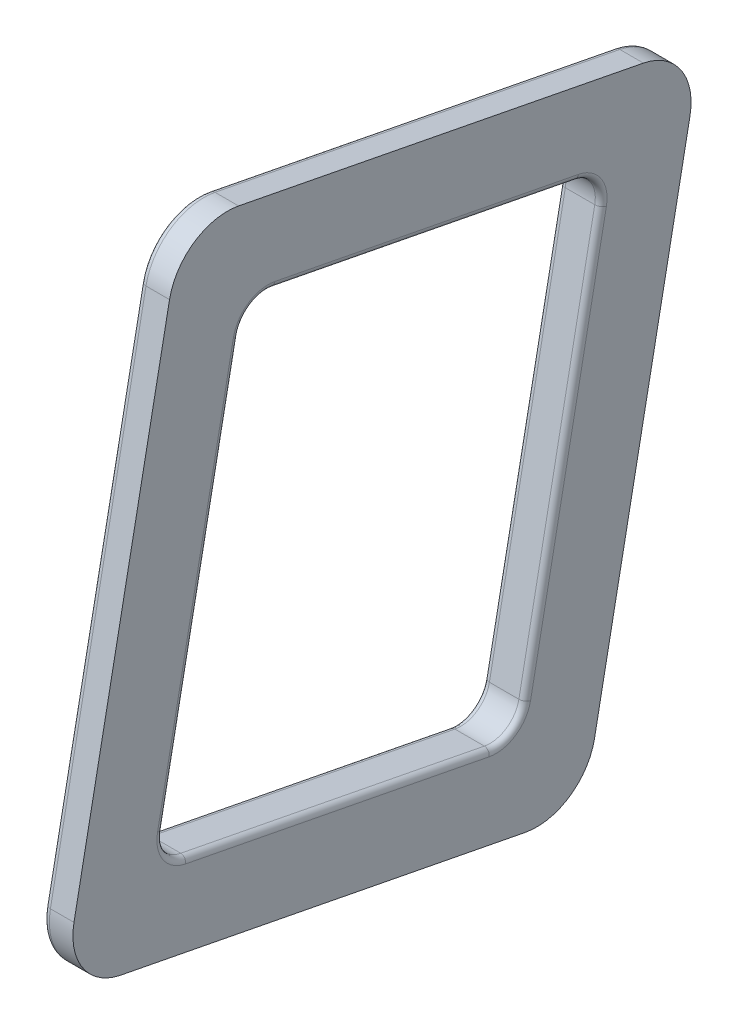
ISO-10303-21;
HEADER;
FILE_DESCRIPTION(('STEP AP214'),'2;1');
FILE_NAME('part.step','',(''),(''),'','','');
FILE_SCHEMA(('AUTOMOTIVE_DESIGN { 1 0 10303 214 1 1 1 1 }'));
ENDSEC;
DATA;
#1=APPLICATION_CONTEXT('core data for automotive mechanical design processes');
#2=APPLICATION_PROTOCOL_DEFINITION('international standard','automotive_design',2000,#1);
#3=PRODUCT_CONTEXT('',#1,'mechanical');
#4=PRODUCT('Part','Part','',(#3));
#5=PRODUCT_RELATED_PRODUCT_CATEGORY('part','',(#4));
#6=PRODUCT_DEFINITION_FORMATION('','',#4);
#7=PRODUCT_DEFINITION_CONTEXT('part definition',#1,'design');
#8=PRODUCT_DEFINITION('design','',#6,#7);
#9=PRODUCT_DEFINITION_SHAPE('','',#8);
#10=(LENGTH_UNIT() NAMED_UNIT(*) SI_UNIT(.MILLI.,.METRE.));
#11=(NAMED_UNIT(*) PLANE_ANGLE_UNIT() SI_UNIT($,.RADIAN.));
#12=(NAMED_UNIT(*) SI_UNIT($,.STERADIAN.) SOLID_ANGLE_UNIT());
#13=UNCERTAINTY_MEASURE_WITH_UNIT(LENGTH_MEASURE(1.E-05),#10,'distance_accuracy_value','');
#14=(GEOMETRIC_REPRESENTATION_CONTEXT(3) GLOBAL_UNCERTAINTY_ASSIGNED_CONTEXT((#13)) GLOBAL_UNIT_ASSIGNED_CONTEXT((#10,
#11,#12)) REPRESENTATION_CONTEXT('',''));
#15=CARTESIAN_POINT('',(0.,0.,0.));
#16=DIRECTION('',(0.,0.,1.));
#17=DIRECTION('',(1.,0.,0.));
#18=AXIS2_PLACEMENT_3D('',#15,#16,#17);
#19=CARTESIAN_POINT('',(-919.690576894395,-276.062680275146,-388.88150695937));
#20=DIRECTION('',(0.,-0.190808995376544,-0.981627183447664));
#21=DIRECTION('',(0.,0.981627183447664,-0.190808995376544));
#22=AXIS2_PLACEMENT_3D('',#19,#20,#21);
#23=PLANE('',#22);
#24=DIRECTION('',(0.,0.981627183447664,-0.190808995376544));
#25=VECTOR('',#24,1.);
#26=CARTESIAN_POINT('',(-920.960576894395,-334.032673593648,-377.613281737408));
#27=LINE('',#26,#25);
#28=CARTESIAN_POINT('',(-920.960576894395,-334.032673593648,-377.613281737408));
#29=VERTEX_POINT('',#28);
#30=CARTESIAN_POINT('',(-920.960576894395,-218.092686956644,-400.149732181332));
#31=VERTEX_POINT('',#30);
#32=EDGE_CURVE('E201',#29,#31,#27,.T.);
#33=ORIENTED_EDGE('',*,*,#32,.F.);
#34=DIRECTION('',(1.,0.,0.));
#35=VECTOR('',#34,1.);
#36=CARTESIAN_POINT('',(-919.690576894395,-334.032673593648,-377.613281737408));
#37=LINE('',#36,#35);
#38=CARTESIAN_POINT('',(-919.690576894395,-334.032673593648,-377.613281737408));
#39=VERTEX_POINT('',#38);
#40=EDGE_CURVE('E166',#29,#39,#37,.T.);
#41=ORIENTED_EDGE('',*,*,#40,.T.);
#42=DIRECTION('',(0.,-0.981627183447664,0.190808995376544));
#43=VECTOR('',#42,1.);
#44=CARTESIAN_POINT('',(-919.690576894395,-218.092686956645,-400.149732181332));
#45=LINE('',#44,#43);
#46=CARTESIAN_POINT('',(-919.690576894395,-218.092686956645,-400.149732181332));
#47=VERTEX_POINT('',#46);
#48=EDGE_CURVE('E157',#39,#47,#45,.F.);
#49=ORIENTED_EDGE('',*,*,#48,.T.);
#50=DIRECTION('',(1.,0.,0.));
#51=VECTOR('',#50,1.);
#52=CARTESIAN_POINT('',(-919.690576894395,-218.092686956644,-400.149732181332));
#53=LINE('',#52,#51);
#54=EDGE_CURVE('E173',#31,#47,#53,.T.);
#55=ORIENTED_EDGE('',*,*,#54,.F.);
#56=EDGE_LOOP('',(#33,#41,#49,#55));
#57=FACE_BOUND('',#56,.T.);
#58=ADVANCED_FACE('F17',(#57),#23,.F.);
#59=CARTESIAN_POINT('',(-919.690576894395,-343.604606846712,-426.856609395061));
#60=DIRECTION('',(0.,0.981627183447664,-0.190808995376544));
#61=DIRECTION('',(0.,0.190808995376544,0.981627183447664));
#62=AXIS2_PLACEMENT_3D('',#59,#60,#61);
#63=PLANE('',#62);
#64=DIRECTION('',(0.,0.190808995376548,0.981627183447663));
#65=VECTOR('',#64,1.);
#66=CARTESIAN_POINT('',(-920.960576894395,-353.176540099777,-476.099937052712));
#67=LINE('',#66,#65);
#68=CARTESIAN_POINT('',(-920.960576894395,-353.176540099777,-476.099937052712));
#69=VERTEX_POINT('',#68);
#70=EDGE_CURVE('E210',#69,#29,#67,.T.);
#71=ORIENTED_EDGE('',*,*,#70,.F.);
#72=DIRECTION('',(1.,0.,0.));
#73=VECTOR('',#72,1.);
#74=CARTESIAN_POINT('',(-919.690576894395,-353.176540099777,-476.099937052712));
#75=LINE('',#74,#73);
#76=CARTESIAN_POINT('',(-919.690576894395,-353.176540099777,-476.099937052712));
#77=VERTEX_POINT('',#76);
#78=EDGE_CURVE('E186',#77,#69,#75,.F.);
#79=ORIENTED_EDGE('',*,*,#78,.F.);
#80=DIRECTION('',(0.,-0.190808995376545,-0.981627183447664));
#81=VECTOR('',#80,1.);
#82=CARTESIAN_POINT('',(-919.690576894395,-333.674029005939,-375.7682152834));
#83=LINE('',#82,#81);
#84=EDGE_CURVE('E338',#77,#39,#83,.F.);
#85=ORIENTED_EDGE('',*,*,#84,.T.);
#86=ORIENTED_EDGE('',*,*,#40,.F.);
#87=EDGE_LOOP('',(#71,#79,#85,#86));
#88=FACE_BOUND('',#87,.T.);
#89=ADVANCED_FACE('F926',(#88),#63,.F.);
#90=CARTESIAN_POINT('',(-920.960576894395,-285.634613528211,-438.124834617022));
#91=DIRECTION('',(-1.,0.,0.));
#92=DIRECTION('',(0.,0.,1.));
#93=AXIS2_PLACEMENT_3D('',#90,#91,#92);
#94=PLANE('',#93);
#95=DIRECTION('',(0.,-0.981627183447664,0.190808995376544));
#96=VECTOR('',#95,1.);
#97=CARTESIAN_POINT('',(-920.960576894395,-295.206546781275,-487.368162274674));
#98=LINE('',#97,#96);
#99=CARTESIAN_POINT('',(-920.960576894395,-237.236553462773,-498.636387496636));
#100=VERTEX_POINT('',#99);
#101=EDGE_CURVE('E179',#100,#69,#98,.T.);
#102=ORIENTED_EDGE('',*,*,#101,.T.);
#103=ORIENTED_EDGE('',*,*,#70,.T.);
#104=ORIENTED_EDGE('',*,*,#32,.T.);
#105=DIRECTION('',(0.,-0.190808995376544,-0.981627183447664));
#106=VECTOR('',#105,1.);
#107=CARTESIAN_POINT('',(-920.960576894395,-227.664620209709,-449.393059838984));
#108=LINE('',#107,#106);
#109=EDGE_CURVE('E194',#31,#100,#108,.T.);
#110=ORIENTED_EDGE('',*,*,#109,.T.);
#111=EDGE_LOOP('',(#102,#103,#104,#110));
#112=FACE_BOUND('',#111,.T.);
#113=DIRECTION('',(0.,-0.190808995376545,-0.981627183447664));
#114=VECTOR('',#113,1.);
#115=CARTESIAN_POINT('',(-920.960576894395,-328.828512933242,-395.767323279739));
#116=LINE('',#115,#114);
#117=CARTESIAN_POINT('',(-920.960576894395,-341.550702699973,-461.217315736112));
#118=VERTEX_POINT('',#117);
#119=CARTESIAN_POINT('',(-920.960576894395,-328.828512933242,-395.767323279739));
#120=VERTEX_POINT('',#119);
#121=EDGE_CURVE('E304',#118,#120,#116,.F.);
#122=ORIENTED_EDGE('',*,*,#121,.F.);
#123=CARTESIAN_POINT('',(-920.960576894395,-334.070703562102,-462.671280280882));
#124=DIRECTION('',(1.,0.,0.));
#125=DIRECTION('',(0.,1.,0.));
#126=AXIS2_PLACEMENT_3D('',#123,#124,#125);
#127=CIRCLE('',#126,7.61999999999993);
#128=CARTESIAN_POINT('',(-920.960576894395,-335.524668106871,-470.151279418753));
#129=VERTEX_POINT('',#128);
#130=EDGE_CURVE('E278',#129,#118,#127,.F.);
#131=ORIENTED_EDGE('',*,*,#130,.F.);
#132=DIRECTION('',(0.,0.981627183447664,-0.190808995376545));
#133=VECTOR('',#132,1.);
#134=CARTESIAN_POINT('',(-920.960576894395,-335.524668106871,-470.151279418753));
#135=LINE('',#134,#133);
#136=CARTESIAN_POINT('',(-920.960576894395,-251.37467780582,-486.508380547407));
#137=VERTEX_POINT('',#136);
#138=EDGE_CURVE('E302',#137,#129,#135,.F.);
#139=ORIENTED_EDGE('',*,*,#138,.F.);
#140=CARTESIAN_POINT('',(-920.960576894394,-249.920713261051,-479.028381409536));
#141=DIRECTION('',(1.,0.,0.));
#142=DIRECTION('',(0.,1.,0.));
#143=AXIS2_PLACEMENT_3D('',#140,#141,#142);
#144=CIRCLE('',#143,7.61999999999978);
#145=CARTESIAN_POINT('',(-920.960576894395,-242.440714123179,-480.482345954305));
#146=VERTEX_POINT('',#145);
#147=EDGE_CURVE('E274',#146,#137,#144,.F.);
#148=ORIENTED_EDGE('',*,*,#147,.F.);
#149=DIRECTION('',(0.,0.190808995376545,0.981627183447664));
#150=VECTOR('',#149,1.);
#151=CARTESIAN_POINT('',(-920.960576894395,-242.440714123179,-480.482345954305));
#152=LINE('',#151,#150);
#153=CARTESIAN_POINT('',(-920.960576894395,-229.718524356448,-415.032353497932));
#154=VERTEX_POINT('',#153);
#155=EDGE_CURVE('E296',#154,#146,#152,.F.);
#156=ORIENTED_EDGE('',*,*,#155,.F.);
#157=CARTESIAN_POINT('',(-920.960576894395,-237.19852349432,-413.578388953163));
#158=DIRECTION('',(1.,0.,0.));
#159=DIRECTION('',(0.,0.,-1.));
#160=AXIS2_PLACEMENT_3D('',#157,#158,#159);
#161=CIRCLE('',#160,7.62000000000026);
#162=CARTESIAN_POINT('',(-920.960576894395,-235.74455894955,-406.098389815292));
#163=VERTEX_POINT('',#162);
#164=EDGE_CURVE('E270',#163,#154,#161,.F.);
#165=ORIENTED_EDGE('',*,*,#164,.F.);
#166=DIRECTION('',(0.,-0.981627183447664,0.190808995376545));
#167=VECTOR('',#166,1.);
#168=CARTESIAN_POINT('',(-920.960576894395,-235.74455894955,-406.098389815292));
#169=LINE('',#168,#167);
#170=CARTESIAN_POINT('',(-920.960576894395,-319.894549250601,-389.741288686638));
#171=VERTEX_POINT('',#170);
#172=EDGE_CURVE('E285',#171,#163,#169,.F.);
#173=ORIENTED_EDGE('',*,*,#172,.F.);
#174=CARTESIAN_POINT('',(-920.960576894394,-321.348513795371,-397.221287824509));
#175=DIRECTION('',(1.,0.,0.));
#176=DIRECTION('',(0.,0.,-1.));
#177=AXIS2_PLACEMENT_3D('',#174,#175,#176);
#178=CIRCLE('',#177,7.62000000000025);
#179=EDGE_CURVE('E282',#120,#171,#178,.F.);
#180=ORIENTED_EDGE('',*,*,#179,.F.);
#181=EDGE_LOOP('',(#122,#131,#139,#148,#156,#165,#173,#180));
#182=FACE_BOUND('',#181,.T.);
#183=ADVANCED_FACE('F199',(#112,#182),#94,.T.);
#184=CARTESIAN_POINT('',(-919.690576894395,-217.850359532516,-398.903065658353));
#185=DIRECTION('',(0.,-0.981627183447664,0.190808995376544));
#186=DIRECTION('',(0.,-0.190808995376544,-0.981627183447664));
#187=AXIS2_PLACEMENT_3D('',#184,#185,#186);
#188=CYLINDRICAL_SURFACE('',#187,1.26999999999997);
#189=CARTESIAN_POINT('',(-919.690576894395,-217.850359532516,-398.903065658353));
#190=DIRECTION('',(0.,-0.981627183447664,0.190808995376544));
#191=DIRECTION('',(0.,-0.190808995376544,-0.981627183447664));
#192=AXIS2_PLACEMENT_3D('',#189,#190,#191);
#193=CIRCLE('',#192,1.26999999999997);
#194=CARTESIAN_POINT('',(-918.420576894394,-217.850359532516,-398.903065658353));
#195=VERTEX_POINT('',#194);
#196=EDGE_CURVE('E197',#195,#47,#193,.F.);
#197=ORIENTED_EDGE('',*,*,#196,.T.);
#198=ORIENTED_EDGE('',*,*,#48,.F.);
#199=CARTESIAN_POINT('',(-919.690576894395,-335.037012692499,-376.124287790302));
#200=DIRECTION('',(0.,-0.829037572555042,-0.559192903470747));
#201=DIRECTION('',(0.,-0.559192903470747,0.829037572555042));
#202=AXIS2_PLACEMENT_3D('',#199,#200,#201);
#203=ELLIPSE('',#202,1.79605122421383,1.27);
#204=CARTESIAN_POINT('',(-918.420576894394,-335.037012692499,-376.124287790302));
#205=VERTEX_POINT('',#204);
#206=EDGE_CURVE('E21',#39,#205,#203,.T.);
#207=ORIENTED_EDGE('',*,*,#206,.T.);
#208=DIRECTION('',(0.,-0.981627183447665,0.190808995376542));
#209=VECTOR('',#208,1.);
#210=CARTESIAN_POINT('',(-918.420576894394,-217.850359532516,-398.903065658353));
#211=LINE('',#210,#209);
#212=EDGE_CURVE('E322',#195,#205,#211,.T.);
#213=ORIENTED_EDGE('',*,*,#212,.F.);
#214=EDGE_LOOP('',(#197,#198,#207,#213));
#215=FACE_BOUND('',#214,.T.);
#216=ADVANCED_FACE('F344',(#215),#188,.F.);
#217=CARTESIAN_POINT('',(-919.690576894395,-334.920695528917,-375.525887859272));
#218=DIRECTION('',(0.,-0.190808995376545,-0.981627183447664));
#219=DIRECTION('',(0.,0.981627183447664,-0.190808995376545));
#220=AXIS2_PLACEMENT_3D('',#217,#218,#219);
#221=CYLINDRICAL_SURFACE('',#220,1.27000000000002);
#222=ORIENTED_EDGE('',*,*,#206,.F.);
#223=ORIENTED_EDGE('',*,*,#84,.F.);
#224=CARTESIAN_POINT('',(-919.690576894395,-354.423206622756,-475.857609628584));
#225=DIRECTION('',(0.,-0.190808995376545,-0.981627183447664));
#226=DIRECTION('',(0.,0.981627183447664,-0.190808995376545));
#227=AXIS2_PLACEMENT_3D('',#224,#225,#226);
#228=CIRCLE('',#227,1.27000000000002);
#229=CARTESIAN_POINT('',(-918.420576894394,-354.423206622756,-475.857609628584));
#230=VERTEX_POINT('',#229);
#231=EDGE_CURVE('E189',#77,#230,#228,.T.);
#232=ORIENTED_EDGE('',*,*,#231,.T.);
#233=DIRECTION('',(0.,-0.190808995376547,-0.981627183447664));
#234=VECTOR('',#233,1.);
#235=CARTESIAN_POINT('',(-918.420576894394,-335.037012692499,-376.124287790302));
#236=LINE('',#235,#234);
#237=EDGE_CURVE('E325',#205,#230,#236,.T.);
#238=ORIENTED_EDGE('',*,*,#237,.F.);
#239=EDGE_LOOP('',(#222,#223,#232,#238));
#240=FACE_BOUND('',#239,.T.);
#241=ADVANCED_FACE('F343',(#240),#221,.F.);
#242=CARTESIAN_POINT('',(-919.690576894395,-295.206546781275,-487.368162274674));
#243=DIRECTION('',(0.,0.190808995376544,0.981627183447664));
#244=DIRECTION('',(0.,-0.981627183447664,0.190808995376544));
#245=AXIS2_PLACEMENT_3D('',#242,#243,#244);
#246=PLANE('',#245);
#247=ORIENTED_EDGE('',*,*,#231,.F.);
#248=ORIENTED_EDGE('',*,*,#78,.T.);
#249=ORIENTED_EDGE('',*,*,#101,.F.);
#250=DIRECTION('',(1.,0.,0.));
#251=VECTOR('',#250,1.);
#252=CARTESIAN_POINT('',(-919.690576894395,-237.236553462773,-498.636387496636));
#253=LINE('',#252,#251);
#254=CARTESIAN_POINT('',(-918.420576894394,-237.236553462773,-498.636387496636));
#255=VERTEX_POINT('',#254);
#256=EDGE_CURVE('E184',#100,#255,#253,.T.);
#257=ORIENTED_EDGE('',*,*,#256,.T.);
#258=DIRECTION('',(0.,0.981627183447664,-0.190808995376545));
#259=VECTOR('',#258,1.);
#260=CARTESIAN_POINT('',(-918.420576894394,-354.423206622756,-475.857609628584));
#261=LINE('',#260,#259);
#262=EDGE_CURVE('E329',#230,#255,#261,.T.);
#263=ORIENTED_EDGE('',*,*,#262,.F.);
#264=EDGE_LOOP('',(#247,#248,#249,#257,#263));
#265=FACE_BOUND('',#264,.T.);
#266=ADVANCED_FACE('F182',(#265),#246,.F.);
#267=CARTESIAN_POINT('',(-919.690576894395,-227.664620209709,-449.393059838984));
#268=DIRECTION('',(0.,-0.981627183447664,0.190808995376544));
#269=DIRECTION('',(0.,-0.190808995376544,-0.981627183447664));
#270=AXIS2_PLACEMENT_3D('',#267,#268,#269);
#271=PLANE('',#270);
#272=ORIENTED_EDGE('',*,*,#196,.F.);
#273=DIRECTION('',(0.,0.190808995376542,0.981627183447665));
#274=VECTOR('',#273,1.);
#275=CARTESIAN_POINT('',(-918.420576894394,-237.236553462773,-498.636387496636));
#276=LINE('',#275,#274);
#277=EDGE_CURVE('E196',#255,#195,#276,.T.);
#278=ORIENTED_EDGE('',*,*,#277,.F.);
#279=ORIENTED_EDGE('',*,*,#256,.F.);
#280=ORIENTED_EDGE('',*,*,#109,.F.);
#281=ORIENTED_EDGE('',*,*,#54,.T.);
#282=EDGE_LOOP('',(#272,#278,#279,#280,#281));
#283=FACE_BOUND('',#282,.T.);
#284=ADVANCED_FACE('F193',(#283),#271,.F.);
#285=CARTESIAN_POINT('',(-919.690576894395,-235.74455894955,-406.098389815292));
#286=DIRECTION('',(0.,-0.981627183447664,0.190808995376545));
#287=DIRECTION('',(0.,-0.190808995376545,-0.981627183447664));
#288=AXIS2_PLACEMENT_3D('',#285,#286,#287);
#289=CYLINDRICAL_SURFACE('',#288,1.26999999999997);
#290=ORIENTED_EDGE('',*,*,#172,.T.);
#291=CARTESIAN_POINT('',(-919.690576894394,-235.74455894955,-406.098389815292));
#292=DIRECTION('',(0.,0.981627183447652,-0.190808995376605));
#293=DIRECTION('',(0.,0.190808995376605,0.981627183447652));
#294=AXIS2_PLACEMENT_3D('',#291,#292,#293);
#295=CIRCLE('',#294,1.27000000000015);
#296=CARTESIAN_POINT('',(-919.690576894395,-235.986886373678,-407.34505633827));
#297=VERTEX_POINT('',#296);
#298=EDGE_CURVE('E326',#297,#163,#295,.T.);
#299=ORIENTED_EDGE('',*,*,#298,.F.);
#300=DIRECTION('',(0.,0.981627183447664,-0.190808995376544));
#301=VECTOR('',#300,1.);
#302=CARTESIAN_POINT('',(-919.690576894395,-278.061881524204,-399.166505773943));
#303=LINE('',#302,#301);
#304=CARTESIAN_POINT('',(-919.690576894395,-320.13687667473,-390.987955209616));
#305=VERTEX_POINT('',#304);
#306=EDGE_CURVE('E328',#305,#297,#303,.T.);
#307=ORIENTED_EDGE('',*,*,#306,.F.);
#308=CARTESIAN_POINT('',(-919.690576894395,-319.894549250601,-389.741288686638));
#309=DIRECTION('',(1.46491954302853E-13,-0.981627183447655,0.190808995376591));
#310=DIRECTION('',(0.,-0.190808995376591,-0.981627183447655));
#311=AXIS2_PLACEMENT_3D('',#308,#309,#310);
#312=CIRCLE('',#311,1.26999999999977);
#313=EDGE_CURVE('E284',#171,#305,#312,.T.);
#314=ORIENTED_EDGE('',*,*,#313,.F.);
#315=EDGE_LOOP('',(#290,#299,#307,#314));
#316=FACE_BOUND('',#315,.T.);
#317=ADVANCED_FACE('F875',(#316),#289,.T.);
#318=CARTESIAN_POINT('',(-919.690576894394,-321.348513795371,-397.221287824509));
#319=DIRECTION('',(1.,0.,0.));
#320=DIRECTION('',(0.,0.,-1.));
#321=AXIS2_PLACEMENT_3D('',#318,#319,#320);
#322=TOROIDAL_SURFACE('',#321,7.61999999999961,1.26999999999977);
#323=CARTESIAN_POINT('',(-919.690576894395,-321.348513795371,-397.221287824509));
#324=DIRECTION('',(1.,0.,0.));
#325=DIRECTION('',(0.,0.,-1.));
#326=AXIS2_PLACEMENT_3D('',#323,#324,#325);
#327=CIRCLE('',#326,6.35000000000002);
#328=CARTESIAN_POINT('',(-919.690576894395,-327.581846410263,-396.009650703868));
#329=VERTEX_POINT('',#328);
#330=EDGE_CURVE('E646',#305,#329,#327,.T.);
#331=ORIENTED_EDGE('',*,*,#330,.T.);
#332=CARTESIAN_POINT('',(-919.690576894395,-328.828512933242,-395.767323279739));
#333=DIRECTION('',(0.,-0.190808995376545,-0.981627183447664));
#334=DIRECTION('',(0.,0.981627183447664,-0.190808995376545));
#335=AXIS2_PLACEMENT_3D('',#332,#333,#334);
#336=CIRCLE('',#335,1.26999999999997);
#337=EDGE_CURVE('E281',#120,#329,#336,.T.);
#338=ORIENTED_EDGE('',*,*,#337,.F.);
#339=ORIENTED_EDGE('',*,*,#179,.T.);
#340=ORIENTED_EDGE('',*,*,#313,.T.);
#341=EDGE_LOOP('',(#331,#338,#339,#340));
#342=FACE_BOUND('',#341,.T.);
#343=ADVANCED_FACE('F699',(#342),#322,.T.);
#344=CARTESIAN_POINT('',(-919.690576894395,-328.828512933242,-395.767323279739));
#345=DIRECTION('',(0.,-0.190808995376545,-0.981627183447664));
#346=DIRECTION('',(0.,0.981627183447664,-0.190808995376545));
#347=AXIS2_PLACEMENT_3D('',#344,#345,#346);
#348=CYLINDRICAL_SURFACE('',#347,1.26999999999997);
#349=ORIENTED_EDGE('',*,*,#121,.T.);
#350=ORIENTED_EDGE('',*,*,#337,.T.);
#351=DIRECTION('',(0.,0.190808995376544,0.981627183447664));
#352=VECTOR('',#351,1.);
#353=CARTESIAN_POINT('',(-919.690576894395,-333.942941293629,-428.734646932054));
#354=LINE('',#353,#352);
#355=CARTESIAN_POINT('',(-919.690576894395,-340.304036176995,-461.459643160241));
#356=VERTEX_POINT('',#355);
#357=EDGE_CURVE('E640',#356,#329,#354,.T.);
#358=ORIENTED_EDGE('',*,*,#357,.F.);
#359=CARTESIAN_POINT('',(-919.690576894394,-341.550702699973,-461.217315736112));
#360=DIRECTION('',(-2.78746332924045E-13,-0.190808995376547,-0.981627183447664));
#361=DIRECTION('',(0.,0.981627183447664,-0.190808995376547));
#362=AXIS2_PLACEMENT_3D('',#359,#360,#361);
#363=CIRCLE('',#362,1.27000000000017);
#364=EDGE_CURVE('E280',#118,#356,#363,.T.);
#365=ORIENTED_EDGE('',*,*,#364,.F.);
#366=EDGE_LOOP('',(#349,#350,#358,#365));
#367=FACE_BOUND('',#366,.T.);
#368=ADVANCED_FACE('F869',(#367),#348,.T.);
#369=CARTESIAN_POINT('',(-919.690576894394,-334.070703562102,-462.671280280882));
#370=DIRECTION('',(1.,0.,0.));
#371=DIRECTION('',(0.,1.,0.));
#372=AXIS2_PLACEMENT_3D('',#369,#370,#371);
#373=TOROIDAL_SURFACE('',#372,7.62000000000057,1.27000000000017);
#374=ORIENTED_EDGE('',*,*,#130,.T.);
#375=ORIENTED_EDGE('',*,*,#364,.T.);
#376=CARTESIAN_POINT('',(-919.690576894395,-334.070703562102,-462.671280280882));
#377=DIRECTION('',(1.,0.,0.));
#378=DIRECTION('',(0.,0.,-1.));
#379=AXIS2_PLACEMENT_3D('',#376,#377,#378);
#380=CIRCLE('',#379,6.35000000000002);
#381=CARTESIAN_POINT('',(-919.690576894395,-335.282340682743,-468.904612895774));
#382=VERTEX_POINT('',#381);
#383=EDGE_CURVE('E631',#356,#382,#380,.T.);
#384=ORIENTED_EDGE('',*,*,#383,.T.);
#385=CARTESIAN_POINT('',(-919.690576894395,-335.524668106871,-470.151279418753));
#386=DIRECTION('',(0.,0.981627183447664,-0.190808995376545));
#387=DIRECTION('',(0.,0.190808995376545,0.981627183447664));
#388=AXIS2_PLACEMENT_3D('',#385,#386,#387);
#389=CIRCLE('',#388,1.26999999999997);
#390=EDGE_CURVE('E277',#129,#382,#389,.T.);
#391=ORIENTED_EDGE('',*,*,#390,.F.);
#392=EDGE_LOOP('',(#374,#375,#384,#391));
#393=FACE_BOUND('',#392,.T.);
#394=ADVANCED_FACE('F870',(#393),#373,.T.);
#395=CARTESIAN_POINT('',(-919.690576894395,-335.524668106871,-470.151279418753));
#396=DIRECTION('',(0.,0.981627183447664,-0.190808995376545));
#397=DIRECTION('',(0.,0.190808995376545,0.981627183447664));
#398=AXIS2_PLACEMENT_3D('',#395,#396,#397);
#399=CYLINDRICAL_SURFACE('',#398,1.26999999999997);
#400=ORIENTED_EDGE('',*,*,#138,.T.);
#401=ORIENTED_EDGE('',*,*,#390,.T.);
#402=DIRECTION('',(0.,-0.981627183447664,0.190808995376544));
#403=VECTOR('',#402,1.);
#404=CARTESIAN_POINT('',(-919.690576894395,-293.207345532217,-477.083163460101));
#405=LINE('',#404,#403);
#406=CARTESIAN_POINT('',(-919.690576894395,-251.132350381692,-485.261714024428));
#407=VERTEX_POINT('',#406);
#408=EDGE_CURVE('E621',#407,#382,#405,.T.);
#409=ORIENTED_EDGE('',*,*,#408,.F.);
#410=CARTESIAN_POINT('',(-919.690576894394,-251.37467780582,-486.508380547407));
#411=DIRECTION('',(0.,0.981627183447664,-0.190808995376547));
#412=DIRECTION('',(0.,0.190808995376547,0.981627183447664));
#413=AXIS2_PLACEMENT_3D('',#410,#411,#412);
#414=CIRCLE('',#413,1.27000000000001);
#415=EDGE_CURVE('E276',#137,#407,#414,.T.);
#416=ORIENTED_EDGE('',*,*,#415,.F.);
#417=EDGE_LOOP('',(#400,#401,#409,#416));
#418=FACE_BOUND('',#417,.T.);
#419=ADVANCED_FACE('F894',(#418),#399,.T.);
#420=CARTESIAN_POINT('',(-919.690576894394,-249.92071326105,-479.028381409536));
#421=DIRECTION('',(1.,0.,0.));
#422=DIRECTION('',(0.,1.,0.));
#423=AXIS2_PLACEMENT_3D('',#420,#421,#422);
#424=TOROIDAL_SURFACE('',#423,7.62000000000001,1.27000000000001);
#425=ORIENTED_EDGE('',*,*,#415,.T.);
#426=CARTESIAN_POINT('',(-919.690576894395,-249.920713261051,-479.028381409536));
#427=DIRECTION('',(1.,0.,0.));
#428=DIRECTION('',(0.,0.,-1.));
#429=AXIS2_PLACEMENT_3D('',#426,#427,#428);
#430=CIRCLE('',#429,6.35000000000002);
#431=CARTESIAN_POINT('',(-919.690576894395,-243.687380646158,-480.240018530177));
#432=VERTEX_POINT('',#431);
#433=EDGE_CURVE('E616',#407,#432,#430,.T.);
#434=ORIENTED_EDGE('',*,*,#433,.T.);
#435=CARTESIAN_POINT('',(-919.690576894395,-242.44071412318,-480.482345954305));
#436=DIRECTION('',(0.,0.190808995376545,0.981627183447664));
#437=DIRECTION('',(0.,-0.981627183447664,0.190808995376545));
#438=AXIS2_PLACEMENT_3D('',#435,#436,#437);
#439=CIRCLE('',#438,1.27000000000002);
#440=EDGE_CURVE('E273',#146,#432,#439,.T.);
#441=ORIENTED_EDGE('',*,*,#440,.F.);
#442=ORIENTED_EDGE('',*,*,#147,.T.);
#443=EDGE_LOOP('',(#425,#434,#441,#442));
#444=FACE_BOUND('',#443,.T.);
#445=ADVANCED_FACE('F899',(#444),#424,.T.);
#446=CARTESIAN_POINT('',(-919.690576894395,-242.44071412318,-480.482345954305));
#447=DIRECTION('',(0.,0.190808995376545,0.981627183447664));
#448=DIRECTION('',(0.,-0.981627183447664,0.190808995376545));
#449=AXIS2_PLACEMENT_3D('',#446,#447,#448);
#450=CYLINDRICAL_SURFACE('',#449,1.27000000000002);
#451=ORIENTED_EDGE('',*,*,#155,.T.);
#452=ORIENTED_EDGE('',*,*,#440,.T.);
#453=DIRECTION('',(0.,-0.190808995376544,-0.981627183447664));
#454=VECTOR('',#453,1.);
#455=CARTESIAN_POINT('',(-919.690576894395,-237.326285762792,-447.51502230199));
#456=LINE('',#455,#454);
#457=CARTESIAN_POINT('',(-919.690576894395,-230.965190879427,-414.790026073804));
#458=VERTEX_POINT('',#457);
#459=EDGE_CURVE('E602',#458,#432,#456,.T.);
#460=ORIENTED_EDGE('',*,*,#459,.F.);
#461=CARTESIAN_POINT('',(-919.690576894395,-229.718524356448,-415.032353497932));
#462=DIRECTION('',(0.,0.190808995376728,0.981627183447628));
#463=DIRECTION('',(0.,-0.981627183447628,0.190808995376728));
#464=AXIS2_PLACEMENT_3D('',#461,#462,#463);
#465=CIRCLE('',#464,1.27000000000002);
#466=EDGE_CURVE('E272',#154,#458,#465,.T.);
#467=ORIENTED_EDGE('',*,*,#466,.F.);
#468=EDGE_LOOP('',(#451,#452,#460,#467));
#469=FACE_BOUND('',#468,.T.);
#470=ADVANCED_FACE('F902',(#469),#450,.T.);
#471=CARTESIAN_POINT('',(-919.690576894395,-237.19852349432,-413.578388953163));
#472=DIRECTION('',(1.,0.,0.));
#473=DIRECTION('',(0.,0.,-1.));
#474=AXIS2_PLACEMENT_3D('',#471,#472,#473);
#475=TOROIDAL_SURFACE('',#474,7.62000000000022,1.27000000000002);
#476=CARTESIAN_POINT('',(-919.690576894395,-237.198523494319,-413.578388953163));
#477=DIRECTION('',(1.,0.,0.));
#478=DIRECTION('',(0.,0.,-1.));
#479=AXIS2_PLACEMENT_3D('',#476,#477,#478);
#480=CIRCLE('',#479,6.35000000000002);
#481=EDGE_CURVE('E591',#458,#297,#480,.T.);
#482=ORIENTED_EDGE('',*,*,#481,.T.);
#483=ORIENTED_EDGE('',*,*,#298,.T.);
#484=ORIENTED_EDGE('',*,*,#164,.T.);
#485=ORIENTED_EDGE('',*,*,#466,.T.);
#486=EDGE_LOOP('',(#482,#483,#484,#485));
#487=FACE_BOUND('',#486,.T.);
#488=ADVANCED_FACE('F908',(#487),#475,.T.);
#489=CARTESIAN_POINT('',(-918.420576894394,-285.634613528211,-438.124834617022));
#490=DIRECTION('',(-1.,0.,0.));
#491=DIRECTION('',(0.,0.,1.));
#492=AXIS2_PLACEMENT_3D('',#489,#490,#491);
#493=PLANE('',#492);
#494=ORIENTED_EDGE('',*,*,#262,.T.);
#495=ORIENTED_EDGE('',*,*,#277,.T.);
#496=ORIENTED_EDGE('',*,*,#212,.T.);
#497=ORIENTED_EDGE('',*,*,#237,.T.);
#498=EDGE_LOOP('',(#494,#495,#496,#497));
#499=FACE_BOUND('',#498,.T.);
#500=DIRECTION('',(0.,0.190808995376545,0.981627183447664));
#501=VECTOR('',#500,1.);
#502=CARTESIAN_POINT('',(-918.420576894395,-358.319399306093,-469.278300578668));
#503=LINE('',#502,#501);
#504=CARTESIAN_POINT('',(-918.420576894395,-341.356479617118,-382.011643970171));
#505=VERTEX_POINT('',#504);
#506=CARTESIAN_POINT('',(-918.420576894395,-358.319399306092,-469.278300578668));
#507=VERTEX_POINT('',#506);
#508=EDGE_CURVE('E560',#505,#507,#503,.F.);
#509=ORIENTED_EDGE('',*,*,#508,.F.);
#510=CARTESIAN_POINT('',(-918.420576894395,-330.136480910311,-384.192590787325));
#511=DIRECTION('',(1.,0.,0.));
#512=DIRECTION('',(0.,0.,-1.));
#513=AXIS2_PLACEMENT_3D('',#510,#511,#512);
#514=CIRCLE('',#513,11.4300000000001);
#515=CARTESIAN_POINT('',(-918.420576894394,-327.955534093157,-372.972592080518));
#516=VERTEX_POINT('',#515);
#517=EDGE_CURVE('E258',#516,#505,#514,.T.);
#518=ORIENTED_EDGE('',*,*,#517,.F.);
#519=DIRECTION('',(0.,0.981627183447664,-0.190808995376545));
#520=VECTOR('',#519,1.);
#521=CARTESIAN_POINT('',(-918.420576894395,-327.955534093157,-372.972592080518));
#522=LINE('',#521,#520);
#523=CARTESIAN_POINT('',(-918.420576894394,-221.988879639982,-393.570423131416));
#524=VERTEX_POINT('',#523);
#525=EDGE_CURVE('E545',#524,#516,#522,.F.);
#526=ORIENTED_EDGE('',*,*,#525,.F.);
#527=CARTESIAN_POINT('',(-918.420576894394,-224.169826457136,-404.790421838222));
#528=DIRECTION('',(1.,0.,0.));
#529=DIRECTION('',(0.,0.,-1.));
#530=AXIS2_PLACEMENT_3D('',#527,#528,#529);
#531=CIRCLE('',#530,11.4299999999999);
#532=CARTESIAN_POINT('',(-918.420576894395,-212.949827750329,-406.971368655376));
#533=VERTEX_POINT('',#532);
#534=EDGE_CURVE('E254',#533,#524,#531,.T.);
#535=ORIENTED_EDGE('',*,*,#534,.F.);
#536=DIRECTION('',(0.,-0.190808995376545,-0.981627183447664));
#537=VECTOR('',#536,1.);
#538=CARTESIAN_POINT('',(-918.420576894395,-212.949827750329,-406.971368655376));
#539=LINE('',#538,#537);
#540=CARTESIAN_POINT('',(-918.420576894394,-229.912747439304,-494.238025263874));
#541=VERTEX_POINT('',#540);
#542=EDGE_CURVE('E421',#541,#533,#539,.F.);
#543=ORIENTED_EDGE('',*,*,#542,.F.);
#544=CARTESIAN_POINT('',(-918.420576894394,-241.13274614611,-492.05707844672));
#545=DIRECTION('',(1.,0.,0.));
#546=DIRECTION('',(0.,0.,-1.));
#547=AXIS2_PLACEMENT_3D('',#544,#545,#546);
#548=CIRCLE('',#547,11.4300000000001);
#549=CARTESIAN_POINT('',(-918.420576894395,-243.313692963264,-503.277077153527));
#550=VERTEX_POINT('',#549);
#551=EDGE_CURVE('E266',#550,#541,#548,.T.);
#552=ORIENTED_EDGE('',*,*,#551,.F.);
#553=DIRECTION('',(0.,-0.981627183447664,0.190808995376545));
#554=VECTOR('',#553,1.);
#555=CARTESIAN_POINT('',(-918.420576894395,-243.313692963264,-503.277077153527));
#556=LINE('',#555,#554);
#557=CARTESIAN_POINT('',(-918.420576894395,-349.28034741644,-482.679246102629));
#558=VERTEX_POINT('',#557);
#559=EDGE_CURVE('E268',#558,#550,#556,.F.);
#560=ORIENTED_EDGE('',*,*,#559,.F.);
#561=CARTESIAN_POINT('',(-918.420576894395,-347.099400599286,-471.459247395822));
#562=DIRECTION('',(1.,0.,0.));
#563=DIRECTION('',(0.,1.,0.));
#564=AXIS2_PLACEMENT_3D('',#561,#562,#563);
#565=CIRCLE('',#564,11.4299999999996);
#566=EDGE_CURVE('E262',#507,#558,#565,.T.);
#567=ORIENTED_EDGE('',*,*,#566,.F.);
#568=EDGE_LOOP('',(#509,#518,#526,#535,#543,#552,#560,#567));
#569=FACE_BOUND('',#568,.T.);
#570=ADVANCED_FACE('F346',(#499,#569),#493,.T.);
#571=CARTESIAN_POINT('',(-912.070576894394,-278.061881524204,-399.166505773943));
#572=DIRECTION('',(0.,-0.190808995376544,-0.981627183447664));
#573=DIRECTION('',(0.,0.981627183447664,-0.190808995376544));
#574=AXIS2_PLACEMENT_3D('',#571,#572,#573);
#575=PLANE('',#574);
#576=DIRECTION('',(0.,0.981627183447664,-0.190808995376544));
#577=VECTOR('',#576,1.);
#578=CARTESIAN_POINT('',(-913.340576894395,-320.13687667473,-390.987955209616));
#579=LINE('',#578,#577);
#580=CARTESIAN_POINT('',(-913.340576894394,-320.13687667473,-390.987955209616));
#581=VERTEX_POINT('',#580);
#582=CARTESIAN_POINT('',(-913.340576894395,-235.986886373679,-407.34505633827));
#583=VERTEX_POINT('',#582);
#584=EDGE_CURVE('E425',#581,#583,#579,.T.);
#585=ORIENTED_EDGE('',*,*,#584,.F.);
#586=DIRECTION('',(1.,0.,0.));
#587=VECTOR('',#586,1.);
#588=CARTESIAN_POINT('',(-919.690576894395,-320.13687667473,-390.987955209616));
#589=LINE('',#588,#587);
#590=EDGE_CURVE('E643',#581,#305,#589,.F.);
#591=ORIENTED_EDGE('',*,*,#590,.T.);
#592=ORIENTED_EDGE('',*,*,#306,.T.);
#593=DIRECTION('',(1.,0.,0.));
#594=VECTOR('',#593,1.);
#595=CARTESIAN_POINT('',(-919.690576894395,-235.986886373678,-407.34505633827));
#596=LINE('',#595,#594);
#597=EDGE_CURVE('E586',#297,#583,#596,.T.);
#598=ORIENTED_EDGE('',*,*,#597,.T.);
#599=EDGE_LOOP('',(#585,#591,#592,#598));
#600=FACE_BOUND('',#599,.T.);
#601=ADVANCED_FACE('F879',(#600),#575,.T.);
#602=CARTESIAN_POINT('',(-919.690576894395,-321.348513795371,-397.221287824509));
#603=DIRECTION('',(1.,0.,0.));
#604=DIRECTION('',(0.,0.,-1.));
#605=AXIS2_PLACEMENT_3D('',#602,#603,#604);
#606=CYLINDRICAL_SURFACE('',#605,6.35000000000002);
#607=CARTESIAN_POINT('',(-913.340576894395,-321.348513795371,-397.221287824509));
#608=DIRECTION('',(-1.,0.,0.));
#609=DIRECTION('',(0.,0.,1.));
#610=AXIS2_PLACEMENT_3D('',#607,#608,#609);
#611=CIRCLE('',#610,6.35000000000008);
#612=CARTESIAN_POINT('',(-913.340576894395,-327.581846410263,-396.009650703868));
#613=VERTEX_POINT('',#612);
#614=EDGE_CURVE('E521',#613,#581,#611,.T.);
#615=ORIENTED_EDGE('',*,*,#614,.F.);
#616=DIRECTION('',(1.,0.,0.));
#617=VECTOR('',#616,1.);
#618=CARTESIAN_POINT('',(-912.070576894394,-327.581846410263,-396.009650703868));
#619=LINE('',#618,#617);
#620=EDGE_CURVE('E638',#329,#613,#619,.T.);
#621=ORIENTED_EDGE('',*,*,#620,.F.);
#622=ORIENTED_EDGE('',*,*,#330,.F.);
#623=ORIENTED_EDGE('',*,*,#590,.F.);
#624=EDGE_LOOP('',(#615,#621,#622,#623));
#625=FACE_BOUND('',#624,.T.);
#626=ADVANCED_FACE('F703',(#625),#606,.F.);
#627=CARTESIAN_POINT('',(-912.070576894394,-333.942941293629,-428.734646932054));
#628=DIRECTION('',(0.,0.981627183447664,-0.190808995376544));
#629=DIRECTION('',(0.,0.190808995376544,0.981627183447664));
#630=AXIS2_PLACEMENT_3D('',#627,#628,#629);
#631=PLANE('',#630);
#632=DIRECTION('',(0.,0.190808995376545,0.981627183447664));
#633=VECTOR('',#632,1.);
#634=CARTESIAN_POINT('',(-913.340576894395,-340.304036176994,-461.459643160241));
#635=LINE('',#634,#633);
#636=CARTESIAN_POINT('',(-913.340576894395,-340.304036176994,-461.45964316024));
#637=VERTEX_POINT('',#636);
#638=EDGE_CURVE('E516',#637,#613,#635,.T.);
#639=ORIENTED_EDGE('',*,*,#638,.F.);
#640=DIRECTION('',(1.,0.,0.));
#641=VECTOR('',#640,1.);
#642=CARTESIAN_POINT('',(-919.690576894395,-340.304036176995,-461.45964316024));
#643=LINE('',#642,#641);
#644=EDGE_CURVE('E628',#637,#356,#643,.F.);
#645=ORIENTED_EDGE('',*,*,#644,.T.);
#646=ORIENTED_EDGE('',*,*,#357,.T.);
#647=ORIENTED_EDGE('',*,*,#620,.T.);
#648=EDGE_LOOP('',(#639,#645,#646,#647));
#649=FACE_BOUND('',#648,.T.);
#650=ADVANCED_FACE('F707',(#649),#631,.T.);
#651=CARTESIAN_POINT('',(-919.690576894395,-334.070703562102,-462.671280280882));
#652=DIRECTION('',(1.,0.,0.));
#653=DIRECTION('',(0.,0.,-1.));
#654=AXIS2_PLACEMENT_3D('',#651,#652,#653);
#655=CYLINDRICAL_SURFACE('',#654,6.35000000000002);
#656=CARTESIAN_POINT('',(-913.340576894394,-334.070703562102,-462.671280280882));
#657=DIRECTION('',(-1.,0.,0.));
#658=DIRECTION('',(0.,0.,1.));
#659=AXIS2_PLACEMENT_3D('',#656,#657,#658);
#660=CIRCLE('',#659,6.34999999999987);
#661=CARTESIAN_POINT('',(-913.340576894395,-335.282340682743,-468.904612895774));
#662=VERTEX_POINT('',#661);
#663=EDGE_CURVE('E511',#662,#637,#660,.T.);
#664=ORIENTED_EDGE('',*,*,#663,.F.);
#665=DIRECTION('',(1.,0.,0.));
#666=VECTOR('',#665,1.);
#667=CARTESIAN_POINT('',(-912.070576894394,-335.282340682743,-468.904612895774));
#668=LINE('',#667,#666);
#669=EDGE_CURVE('E617',#382,#662,#668,.T.);
#670=ORIENTED_EDGE('',*,*,#669,.F.);
#671=ORIENTED_EDGE('',*,*,#383,.F.);
#672=ORIENTED_EDGE('',*,*,#644,.F.);
#673=EDGE_LOOP('',(#664,#670,#671,#672));
#674=FACE_BOUND('',#673,.T.);
#675=ADVANCED_FACE('F865',(#674),#655,.F.);
#676=CARTESIAN_POINT('',(-912.070576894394,-293.207345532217,-477.083163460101));
#677=DIRECTION('',(0.,0.190808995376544,0.981627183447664));
#678=DIRECTION('',(0.,-0.981627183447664,0.190808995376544));
#679=AXIS2_PLACEMENT_3D('',#676,#677,#678);
#680=PLANE('',#679);
#681=DIRECTION('',(0.,-0.981627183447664,0.190808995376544));
#682=VECTOR('',#681,1.);
#683=CARTESIAN_POINT('',(-913.340576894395,-251.132350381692,-485.261714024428));
#684=LINE('',#683,#682);
#685=CARTESIAN_POINT('',(-913.340576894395,-251.132350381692,-485.261714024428));
#686=VERTEX_POINT('',#685);
#687=EDGE_CURVE('E506',#686,#662,#684,.T.);
#688=ORIENTED_EDGE('',*,*,#687,.F.);
#689=DIRECTION('',(1.,0.,0.));
#690=VECTOR('',#689,1.);
#691=CARTESIAN_POINT('',(-912.070576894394,-251.132350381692,-485.261714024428));
#692=LINE('',#691,#690);
#693=EDGE_CURVE('E613',#686,#407,#692,.F.);
#694=ORIENTED_EDGE('',*,*,#693,.T.);
#695=ORIENTED_EDGE('',*,*,#408,.T.);
#696=ORIENTED_EDGE('',*,*,#669,.T.);
#697=EDGE_LOOP('',(#688,#694,#695,#696));
#698=FACE_BOUND('',#697,.T.);
#699=ADVANCED_FACE('F890',(#698),#680,.T.);
#700=CARTESIAN_POINT('',(-919.690576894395,-249.920713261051,-479.028381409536));
#701=DIRECTION('',(1.,0.,0.));
#702=DIRECTION('',(0.,0.,-1.));
#703=AXIS2_PLACEMENT_3D('',#700,#701,#702);
#704=CYLINDRICAL_SURFACE('',#703,6.35000000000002);
#705=ORIENTED_EDGE('',*,*,#433,.F.);
#706=ORIENTED_EDGE('',*,*,#693,.F.);
#707=CARTESIAN_POINT('',(-913.340576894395,-249.920713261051,-479.028381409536));
#708=DIRECTION('',(-1.,0.,0.));
#709=DIRECTION('',(0.,0.,1.));
#710=AXIS2_PLACEMENT_3D('',#707,#708,#709);
#711=CIRCLE('',#710,6.35000000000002);
#712=CARTESIAN_POINT('',(-913.340576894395,-243.687380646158,-480.240018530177));
#713=VERTEX_POINT('',#712);
#714=EDGE_CURVE('E501',#713,#686,#711,.T.);
#715=ORIENTED_EDGE('',*,*,#714,.F.);
#716=DIRECTION('',(1.,0.,0.));
#717=VECTOR('',#716,1.);
#718=CARTESIAN_POINT('',(-912.070576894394,-243.687380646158,-480.240018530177));
#719=LINE('',#718,#717);
#720=EDGE_CURVE('E600',#432,#713,#719,.T.);
#721=ORIENTED_EDGE('',*,*,#720,.F.);
#722=EDGE_LOOP('',(#705,#706,#715,#721));
#723=FACE_BOUND('',#722,.T.);
#724=ADVANCED_FACE('F889',(#723),#704,.F.);
#725=CARTESIAN_POINT('',(-912.070576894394,-237.326285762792,-447.51502230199));
#726=DIRECTION('',(0.,-0.981627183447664,0.190808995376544));
#727=DIRECTION('',(0.,-0.190808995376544,-0.981627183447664));
#728=AXIS2_PLACEMENT_3D('',#725,#726,#727);
#729=PLANE('',#728);
#730=DIRECTION('',(0.,-0.190808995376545,-0.981627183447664));
#731=VECTOR('',#730,1.);
#732=CARTESIAN_POINT('',(-913.340576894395,-230.965190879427,-414.790026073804));
#733=LINE('',#732,#731);
#734=CARTESIAN_POINT('',(-913.340576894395,-230.965190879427,-414.790026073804));
#735=VERTEX_POINT('',#734);
#736=EDGE_CURVE('E496',#735,#713,#733,.T.);
#737=ORIENTED_EDGE('',*,*,#736,.F.);
#738=DIRECTION('',(1.,0.,0.));
#739=VECTOR('',#738,1.);
#740=CARTESIAN_POINT('',(-919.690576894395,-230.965190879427,-414.790026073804));
#741=LINE('',#740,#739);
#742=EDGE_CURVE('E269',#735,#458,#741,.F.);
#743=ORIENTED_EDGE('',*,*,#742,.T.);
#744=ORIENTED_EDGE('',*,*,#459,.T.);
#745=ORIENTED_EDGE('',*,*,#720,.T.);
#746=EDGE_LOOP('',(#737,#743,#744,#745));
#747=FACE_BOUND('',#746,.T.);
#748=ADVANCED_FACE('F903',(#747),#729,.T.);
#749=CARTESIAN_POINT('',(-919.690576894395,-237.198523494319,-413.578388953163));
#750=DIRECTION('',(1.,0.,0.));
#751=DIRECTION('',(0.,0.,-1.));
#752=AXIS2_PLACEMENT_3D('',#749,#750,#751);
#753=CYLINDRICAL_SURFACE('',#752,6.35000000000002);
#754=CARTESIAN_POINT('',(-913.340576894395,-237.198523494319,-413.578388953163));
#755=DIRECTION('',(-1.,0.,0.));
#756=DIRECTION('',(0.,0.,1.));
#757=AXIS2_PLACEMENT_3D('',#754,#755,#756);
#758=CIRCLE('',#757,6.34999999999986);
#759=EDGE_CURVE('E486',#583,#735,#758,.T.);
#760=ORIENTED_EDGE('',*,*,#759,.F.);
#761=ORIENTED_EDGE('',*,*,#597,.F.);
#762=ORIENTED_EDGE('',*,*,#481,.F.);
#763=ORIENTED_EDGE('',*,*,#742,.F.);
#764=EDGE_LOOP('',(#760,#761,#762,#763));
#765=FACE_BOUND('',#764,.T.);
#766=ADVANCED_FACE('F797',(#765),#753,.F.);
#767=CARTESIAN_POINT('',(-917.150576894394,-241.13274614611,-492.05707844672));
#768=DIRECTION('',(1.,0.,0.));
#769=DIRECTION('',(0.,0.,-1.));
#770=AXIS2_PLACEMENT_3D('',#767,#768,#769);
#771=TOROIDAL_SURFACE('',#770,11.4300000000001,1.27000000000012);
#772=CARTESIAN_POINT('',(-917.150576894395,-241.13274614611,-492.05707844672));
#773=DIRECTION('',(1.,0.,0.));
#774=DIRECTION('',(0.,0.,-1.));
#775=AXIS2_PLACEMENT_3D('',#772,#773,#774);
#776=CIRCLE('',#775,12.7);
#777=CARTESIAN_POINT('',(-917.150576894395,-243.556020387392,-504.523743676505));
#778=VERTEX_POINT('',#777);
#779=CARTESIAN_POINT('',(-917.150576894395,-228.666080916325,-494.480352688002));
#780=VERTEX_POINT('',#779);
#781=EDGE_CURVE('E485',#778,#780,#776,.T.);
#782=ORIENTED_EDGE('',*,*,#781,.F.);
#783=CARTESIAN_POINT('',(-917.150576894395,-243.313692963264,-503.277077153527));
#784=DIRECTION('',(0.,-0.981627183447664,0.190808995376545));
#785=DIRECTION('',(0.,-0.190808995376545,-0.981627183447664));
#786=AXIS2_PLACEMENT_3D('',#783,#784,#785);
#787=CIRCLE('',#786,1.27000000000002);
#788=EDGE_CURVE('E265',#550,#778,#787,.T.);
#789=ORIENTED_EDGE('',*,*,#788,.F.);
#790=ORIENTED_EDGE('',*,*,#551,.T.);
#791=CARTESIAN_POINT('',(-917.150576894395,-229.912747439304,-494.238025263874));
#792=DIRECTION('',(0.,-0.190808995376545,-0.981627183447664));
#793=DIRECTION('',(0.,0.981627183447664,-0.190808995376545));
#794=AXIS2_PLACEMENT_3D('',#791,#792,#793);
#795=CIRCLE('',#794,1.27000000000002);
#796=EDGE_CURVE('E530',#780,#541,#795,.F.);
#797=ORIENTED_EDGE('',*,*,#796,.F.);
#798=EDGE_LOOP('',(#782,#789,#790,#797));
#799=FACE_BOUND('',#798,.T.);
#800=ADVANCED_FACE('F768',(#799),#771,.T.);
#801=CARTESIAN_POINT('',(-917.150576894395,-243.313692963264,-503.277077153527));
#802=DIRECTION('',(0.,-0.981627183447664,0.190808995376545));
#803=DIRECTION('',(0.,-0.190808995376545,-0.981627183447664));
#804=AXIS2_PLACEMENT_3D('',#801,#802,#803);
#805=CYLINDRICAL_SURFACE('',#804,1.27000000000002);
#806=ORIENTED_EDGE('',*,*,#559,.T.);
#807=ORIENTED_EDGE('',*,*,#788,.T.);
#808=DIRECTION('',(0.,-0.981627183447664,0.190808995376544));
#809=VECTOR('',#808,1.);
#810=CARTESIAN_POINT('',(-917.150576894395,-296.53934761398,-494.224828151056));
#811=LINE('',#810,#809);
#812=CARTESIAN_POINT('',(-917.150576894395,-349.522674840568,-483.925912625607));
#813=VERTEX_POINT('',#812);
#814=EDGE_CURVE('E480',#778,#813,#811,.T.);
#815=ORIENTED_EDGE('',*,*,#814,.T.);
#816=CARTESIAN_POINT('',(-917.150576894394,-349.28034741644,-482.679246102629));
#817=DIRECTION('',(0.,-0.981627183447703,0.190808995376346));
#818=DIRECTION('',(0.,-0.190808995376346,-0.981627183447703));
#819=AXIS2_PLACEMENT_3D('',#816,#817,#818);
#820=CIRCLE('',#819,1.27000000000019);
#821=EDGE_CURVE('E264',#558,#813,#820,.T.);
#822=ORIENTED_EDGE('',*,*,#821,.F.);
#823=EDGE_LOOP('',(#806,#807,#815,#822));
#824=FACE_BOUND('',#823,.T.);
#825=ADVANCED_FACE('F788',(#824),#805,.T.);
#826=CARTESIAN_POINT('',(-917.150576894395,-347.099400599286,-471.459247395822));
#827=DIRECTION('',(1.,0.,0.));
#828=DIRECTION('',(0.,1.,0.));
#829=AXIS2_PLACEMENT_3D('',#826,#827,#828);
#830=TOROIDAL_SURFACE('',#829,11.4299999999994,1.27000000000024);
#831=CARTESIAN_POINT('',(-917.150576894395,-347.099400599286,-471.459247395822));
#832=DIRECTION('',(1.,0.,0.));
#833=DIRECTION('',(0.,0.,-1.));
#834=AXIS2_PLACEMENT_3D('',#831,#832,#833);
#835=CIRCLE('',#834,12.7);
#836=CARTESIAN_POINT('',(-917.150576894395,-359.566065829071,-469.03597315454));
#837=VERTEX_POINT('',#836);
#838=EDGE_CURVE('E474',#837,#813,#835,.T.);
#839=ORIENTED_EDGE('',*,*,#838,.F.);
#840=CARTESIAN_POINT('',(-917.150576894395,-358.319399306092,-469.278300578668));
#841=DIRECTION('',(0.,0.190808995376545,0.981627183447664));
#842=DIRECTION('',(0.,-0.981627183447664,0.190808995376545));
#843=AXIS2_PLACEMENT_3D('',#840,#841,#842);
#844=CIRCLE('',#843,1.26999999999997);
#845=EDGE_CURVE('E261',#507,#837,#844,.T.);
#846=ORIENTED_EDGE('',*,*,#845,.F.);
#847=ORIENTED_EDGE('',*,*,#566,.T.);
#848=ORIENTED_EDGE('',*,*,#821,.T.);
#849=EDGE_LOOP('',(#839,#846,#847,#848));
#850=FACE_BOUND('',#849,.T.);
#851=ADVANCED_FACE('F785',(#850),#830,.T.);
#852=CARTESIAN_POINT('',(-917.150576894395,-358.319399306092,-469.278300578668));
#853=DIRECTION('',(0.,0.190808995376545,0.981627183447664));
#854=DIRECTION('',(0.,-0.981627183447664,0.190808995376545));
#855=AXIS2_PLACEMENT_3D('',#852,#853,#854);
#856=CYLINDRICAL_SURFACE('',#855,1.26999999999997);
#857=ORIENTED_EDGE('',*,*,#508,.T.);
#858=ORIENTED_EDGE('',*,*,#845,.T.);
#859=DIRECTION('',(0.,0.190808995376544,0.981627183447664));
#860=VECTOR('',#859,1.);
#861=CARTESIAN_POINT('',(-917.150576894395,-351.084605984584,-425.402644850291));
#862=LINE('',#861,#860);
#863=CARTESIAN_POINT('',(-917.150576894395,-342.603146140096,-381.769316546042));
#864=VERTEX_POINT('',#863);
#865=EDGE_CURVE('E469',#837,#864,#862,.T.);
#866=ORIENTED_EDGE('',*,*,#865,.T.);
#867=CARTESIAN_POINT('',(-917.150576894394,-341.356479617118,-382.011643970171));
#868=DIRECTION('',(0.,0.190808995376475,0.981627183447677));
#869=DIRECTION('',(0.,-0.981627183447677,0.190808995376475));
#870=AXIS2_PLACEMENT_3D('',#867,#868,#869);
#871=CIRCLE('',#870,1.27000000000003);
#872=EDGE_CURVE('E260',#505,#864,#871,.T.);
#873=ORIENTED_EDGE('',*,*,#872,.F.);
#874=EDGE_LOOP('',(#857,#858,#866,#873));
#875=FACE_BOUND('',#874,.T.);
#876=ADVANCED_FACE('F781',(#875),#856,.T.);
#877=CARTESIAN_POINT('',(-917.150576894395,-330.136480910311,-384.192590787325));
#878=DIRECTION('',(1.,0.,0.));
#879=DIRECTION('',(0.,0.,-1.));
#880=AXIS2_PLACEMENT_3D('',#877,#878,#879);
#881=TOROIDAL_SURFACE('',#880,11.4300000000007,1.26999999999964);
#882=ORIENTED_EDGE('',*,*,#517,.T.);
#883=ORIENTED_EDGE('',*,*,#872,.T.);
#884=CARTESIAN_POINT('',(-917.150576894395,-330.136480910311,-384.192590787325));
#885=DIRECTION('',(1.,0.,0.));
#886=DIRECTION('',(0.,0.,-1.));
#887=AXIS2_PLACEMENT_3D('',#884,#885,#886);
#888=CIRCLE('',#887,12.7);
#889=CARTESIAN_POINT('',(-917.150576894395,-327.713206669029,-371.725925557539));
#890=VERTEX_POINT('',#889);
#891=EDGE_CURVE('E463',#890,#864,#888,.T.);
#892=ORIENTED_EDGE('',*,*,#891,.F.);
#893=CARTESIAN_POINT('',(-917.150576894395,-327.955534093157,-372.972592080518));
#894=DIRECTION('',(0.,0.981627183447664,-0.190808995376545));
#895=DIRECTION('',(0.,0.190808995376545,0.981627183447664));
#896=AXIS2_PLACEMENT_3D('',#893,#894,#895);
#897=CIRCLE('',#896,1.26999999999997);
#898=EDGE_CURVE('E257',#516,#890,#897,.T.);
#899=ORIENTED_EDGE('',*,*,#898,.F.);
#900=EDGE_LOOP('',(#882,#883,#892,#899));
#901=FACE_BOUND('',#900,.T.);
#902=ADVANCED_FACE('F778',(#901),#881,.T.);
#903=CARTESIAN_POINT('',(-917.150576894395,-327.955534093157,-372.972592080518));
#904=DIRECTION('',(0.,0.981627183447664,-0.190808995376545));
#905=DIRECTION('',(0.,0.190808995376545,0.981627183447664));
#906=AXIS2_PLACEMENT_3D('',#903,#904,#905);
#907=CYLINDRICAL_SURFACE('',#906,1.26999999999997);
#908=DIRECTION('',(0.,0.981627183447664,-0.190808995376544));
#909=VECTOR('',#908,1.);
#910=CARTESIAN_POINT('',(-917.150576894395,-274.729879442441,-382.024841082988));
#911=LINE('',#910,#909);
#912=CARTESIAN_POINT('',(-917.150576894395,-221.746552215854,-392.323756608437));
#913=VERTEX_POINT('',#912);
#914=EDGE_CURVE('E458',#890,#913,#911,.T.);
#915=ORIENTED_EDGE('',*,*,#914,.T.);
#916=CARTESIAN_POINT('',(-917.150576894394,-221.988879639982,-393.570423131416));
#917=DIRECTION('',(0.,0.981627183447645,-0.190808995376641));
#918=DIRECTION('',(0.,0.190808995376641,0.981627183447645));
#919=AXIS2_PLACEMENT_3D('',#916,#917,#918);
#920=CIRCLE('',#919,1.26999999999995);
#921=EDGE_CURVE('E256',#524,#913,#920,.T.);
#922=ORIENTED_EDGE('',*,*,#921,.F.);
#923=ORIENTED_EDGE('',*,*,#525,.T.);
#924=ORIENTED_EDGE('',*,*,#898,.T.);
#925=EDGE_LOOP('',(#915,#922,#923,#924));
#926=FACE_BOUND('',#925,.T.);
#927=ADVANCED_FACE('F776',(#926),#907,.T.);
#928=CARTESIAN_POINT('',(-917.150576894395,-224.169826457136,-404.790421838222));
#929=DIRECTION('',(1.,0.,0.));
#930=DIRECTION('',(0.,0.,-1.));
#931=AXIS2_PLACEMENT_3D('',#928,#929,#930);
#932=TOROIDAL_SURFACE('',#931,11.4300000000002,1.26999999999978);
#933=ORIENTED_EDGE('',*,*,#921,.T.);
#934=CARTESIAN_POINT('',(-917.150576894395,-224.169826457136,-404.790421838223));
#935=DIRECTION('',(1.,0.,0.));
#936=DIRECTION('',(0.,0.,-1.));
#937=AXIS2_PLACEMENT_3D('',#934,#935,#936);
#938=CIRCLE('',#937,12.7);
#939=CARTESIAN_POINT('',(-917.150576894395,-211.70316122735,-407.213696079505));
#940=VERTEX_POINT('',#939);
#941=EDGE_CURVE('E434',#940,#913,#938,.T.);
#942=ORIENTED_EDGE('',*,*,#941,.F.);
#943=CARTESIAN_POINT('',(-917.150576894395,-212.949827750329,-406.971368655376));
#944=DIRECTION('',(0.,-0.190808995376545,-0.981627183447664));
#945=DIRECTION('',(0.,0.981627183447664,-0.190808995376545));
#946=AXIS2_PLACEMENT_3D('',#943,#944,#945);
#947=CIRCLE('',#946,1.27000000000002);
#948=EDGE_CURVE('E416',#533,#940,#947,.T.);
#949=ORIENTED_EDGE('',*,*,#948,.F.);
#950=ORIENTED_EDGE('',*,*,#534,.T.);
#951=EDGE_LOOP('',(#933,#942,#949,#950));
#952=FACE_BOUND('',#951,.T.);
#953=ADVANCED_FACE('F435',(#952),#932,.T.);
#954=CARTESIAN_POINT('',(-917.150576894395,-212.949827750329,-406.971368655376));
#955=DIRECTION('',(0.,-0.190808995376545,-0.981627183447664));
#956=DIRECTION('',(0.,0.981627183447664,-0.190808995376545));
#957=AXIS2_PLACEMENT_3D('',#954,#955,#956);
#958=CYLINDRICAL_SURFACE('',#957,1.27000000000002);
#959=ORIENTED_EDGE('',*,*,#542,.T.);
#960=ORIENTED_EDGE('',*,*,#948,.T.);
#961=DIRECTION('',(0.,-0.190808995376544,-0.981627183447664));
#962=VECTOR('',#961,1.);
#963=CARTESIAN_POINT('',(-917.150576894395,-220.184621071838,-450.847024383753));
#964=LINE('',#963,#962);
#965=EDGE_CURVE('E419',#940,#780,#964,.T.);
#966=ORIENTED_EDGE('',*,*,#965,.T.);
#967=ORIENTED_EDGE('',*,*,#796,.T.);
#968=EDGE_LOOP('',(#959,#960,#966,#967));
#969=FACE_BOUND('',#968,.T.);
#970=ADVANCED_FACE('F417',(#969),#958,.T.);
#971=CARTESIAN_POINT('',(-913.340576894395,-319.894549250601,-389.741288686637));
#972=DIRECTION('',(0.,0.981627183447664,-0.190808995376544));
#973=DIRECTION('',(0.,0.190808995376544,0.981627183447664));
#974=AXIS2_PLACEMENT_3D('',#971,#972,#973);
#975=CYLINDRICAL_SURFACE('',#974,1.26999999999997);
#976=ORIENTED_EDGE('',*,*,#584,.T.);
#977=CARTESIAN_POINT('',(-913.340576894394,-235.744558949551,-406.098389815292));
#978=DIRECTION('',(0.,0.98162718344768,-0.190808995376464));
#979=DIRECTION('',(0.,0.190808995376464,0.98162718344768));
#980=AXIS2_PLACEMENT_3D('',#977,#978,#979);
#981=CIRCLE('',#980,1.26999999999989);
#982=CARTESIAN_POINT('',(-912.070576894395,-235.74455894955,-406.098389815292));
#983=VERTEX_POINT('',#982);
#984=EDGE_CURVE('E489',#983,#583,#981,.T.);
#985=ORIENTED_EDGE('',*,*,#984,.F.);
#986=DIRECTION('',(0.,-0.981627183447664,0.190808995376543));
#987=VECTOR('',#986,1.);
#988=CARTESIAN_POINT('',(-912.070576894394,-235.74455894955,-406.098389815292));
#989=LINE('',#988,#987);
#990=CARTESIAN_POINT('',(-912.070576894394,-319.894549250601,-389.741288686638));
#991=VERTEX_POINT('',#990);
#992=EDGE_CURVE('E253',#983,#991,#989,.T.);
#993=ORIENTED_EDGE('',*,*,#992,.T.);
#994=CARTESIAN_POINT('',(-913.340576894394,-319.894549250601,-389.741288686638));
#995=DIRECTION('',(0.,-0.981627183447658,0.190808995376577));
#996=DIRECTION('',(0.,-0.190808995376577,-0.981627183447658));
#997=AXIS2_PLACEMENT_3D('',#994,#995,#996);
#998=CIRCLE('',#997,1.26999999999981);
#999=EDGE_CURVE('E519',#581,#991,#998,.T.);
#1000=ORIENTED_EDGE('',*,*,#999,.F.);
#1001=EDGE_LOOP('',(#976,#985,#993,#1000));
#1002=FACE_BOUND('',#1001,.T.);
#1003=ADVANCED_FACE('F833',(#1002),#975,.T.);
#1004=CARTESIAN_POINT('',(-913.340576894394,-321.348513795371,-397.221287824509));
#1005=DIRECTION('',(-1.,0.,0.));
#1006=DIRECTION('',(0.,0.,1.));
#1007=AXIS2_PLACEMENT_3D('',#1004,#1005,#1006);
#1008=TOROIDAL_SURFACE('',#1007,7.61999999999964,1.26999999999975);
#1009=CARTESIAN_POINT('',(-912.070576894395,-321.348513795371,-397.221287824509));
#1010=DIRECTION('',(-1.,0.,0.));
#1011=DIRECTION('',(0.,0.,1.));
#1012=AXIS2_PLACEMENT_3D('',#1009,#1010,#1011);
#1013=CIRCLE('',#1012,7.62000000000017);
#1014=CARTESIAN_POINT('',(-912.070576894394,-328.828512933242,-395.767323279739));
#1015=VERTEX_POINT('',#1014);
#1016=EDGE_CURVE('E250',#991,#1015,#1013,.F.);
#1017=ORIENTED_EDGE('',*,*,#1016,.T.);
#1018=CARTESIAN_POINT('',(-913.340576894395,-328.828512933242,-395.767323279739));
#1019=DIRECTION('',(0.,0.190808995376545,0.981627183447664));
#1020=DIRECTION('',(0.,-0.981627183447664,0.190808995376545));
#1021=AXIS2_PLACEMENT_3D('',#1018,#1019,#1020);
#1022=CIRCLE('',#1021,1.26999999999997);
#1023=EDGE_CURVE('E514',#613,#1015,#1022,.F.);
#1024=ORIENTED_EDGE('',*,*,#1023,.F.);
#1025=ORIENTED_EDGE('',*,*,#614,.T.);
#1026=ORIENTED_EDGE('',*,*,#999,.T.);
#1027=EDGE_LOOP('',(#1017,#1024,#1025,#1026));
#1028=FACE_BOUND('',#1027,.T.);
#1029=ADVANCED_FACE('F832',(#1028),#1008,.T.);
#1030=CARTESIAN_POINT('',(-913.340576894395,-341.550702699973,-461.217315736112));
#1031=DIRECTION('',(0.,0.190808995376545,0.981627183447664));
#1032=DIRECTION('',(0.,-0.981627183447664,0.190808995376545));
#1033=AXIS2_PLACEMENT_3D('',#1030,#1031,#1032);
#1034=CYLINDRICAL_SURFACE('',#1033,1.26999999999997);
#1035=ORIENTED_EDGE('',*,*,#638,.T.);
#1036=ORIENTED_EDGE('',*,*,#1023,.T.);
#1037=DIRECTION('',(0.,-0.190808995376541,-0.981627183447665));
#1038=VECTOR('',#1037,1.);
#1039=CARTESIAN_POINT('',(-912.070576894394,-328.828512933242,-395.767323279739));
#1040=LINE('',#1039,#1038);
#1041=CARTESIAN_POINT('',(-912.070576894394,-341.550702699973,-461.217315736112));
#1042=VERTEX_POINT('',#1041);
#1043=EDGE_CURVE('E249',#1015,#1042,#1040,.T.);
#1044=ORIENTED_EDGE('',*,*,#1043,.T.);
#1045=CARTESIAN_POINT('',(-913.340576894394,-341.550702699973,-461.217315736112));
#1046=DIRECTION('',(0.,-0.190808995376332,-0.981627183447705));
#1047=DIRECTION('',(0.,0.981627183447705,-0.190808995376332));
#1048=AXIS2_PLACEMENT_3D('',#1045,#1046,#1047);
#1049=CIRCLE('',#1048,1.26999999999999);
#1050=EDGE_CURVE('E509',#637,#1042,#1049,.T.);
#1051=ORIENTED_EDGE('',*,*,#1050,.F.);
#1052=EDGE_LOOP('',(#1035,#1036,#1044,#1051));
#1053=FACE_BOUND('',#1052,.T.);
#1054=ADVANCED_FACE('F711',(#1053),#1034,.T.);
#1055=CARTESIAN_POINT('',(-913.340576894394,-334.070703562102,-462.671280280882));
#1056=DIRECTION('',(-1.,0.,0.));
#1057=DIRECTION('',(0.,-1.,0.));
#1058=AXIS2_PLACEMENT_3D('',#1055,#1056,#1057);
#1059=TOROIDAL_SURFACE('',#1058,7.62000000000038,1.27000000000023);
#1060=CARTESIAN_POINT('',(-912.070576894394,-334.070703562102,-462.671280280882));
#1061=DIRECTION('',(-1.,0.,0.));
#1062=DIRECTION('',(0.,-1.,0.));
#1063=AXIS2_PLACEMENT_3D('',#1060,#1061,#1062);
#1064=CIRCLE('',#1063,7.61999999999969);
#1065=CARTESIAN_POINT('',(-912.070576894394,-335.524668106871,-470.151279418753));
#1066=VERTEX_POINT('',#1065);
#1067=EDGE_CURVE('E246',#1042,#1066,#1064,.F.);
#1068=ORIENTED_EDGE('',*,*,#1067,.T.);
#1069=CARTESIAN_POINT('',(-913.340576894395,-335.524668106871,-470.151279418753));
#1070=DIRECTION('',(0.,-0.981627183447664,0.190808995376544));
#1071=DIRECTION('',(0.,-0.190808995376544,-0.981627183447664));
#1072=AXIS2_PLACEMENT_3D('',#1069,#1070,#1071);
#1073=CIRCLE('',#1072,1.26999999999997);
#1074=EDGE_CURVE('E504',#662,#1066,#1073,.F.);
#1075=ORIENTED_EDGE('',*,*,#1074,.F.);
#1076=ORIENTED_EDGE('',*,*,#663,.T.);
#1077=ORIENTED_EDGE('',*,*,#1050,.T.);
#1078=EDGE_LOOP('',(#1068,#1075,#1076,#1077));
#1079=FACE_BOUND('',#1078,.T.);
#1080=ADVANCED_FACE('F716',(#1079),#1059,.T.);
#1081=CARTESIAN_POINT('',(-913.340576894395,-251.37467780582,-486.508380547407));
#1082=DIRECTION('',(0.,-0.981627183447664,0.190808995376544));
#1083=DIRECTION('',(0.,-0.190808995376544,-0.981627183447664));
#1084=AXIS2_PLACEMENT_3D('',#1081,#1082,#1083);
#1085=CYLINDRICAL_SURFACE('',#1084,1.26999999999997);
#1086=ORIENTED_EDGE('',*,*,#687,.T.);
#1087=ORIENTED_EDGE('',*,*,#1074,.T.);
#1088=DIRECTION('',(0.,0.981627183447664,-0.190808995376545));
#1089=VECTOR('',#1088,1.);
#1090=CARTESIAN_POINT('',(-912.070576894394,-335.524668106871,-470.151279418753));
#1091=LINE('',#1090,#1089);
#1092=CARTESIAN_POINT('',(-912.070576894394,-251.37467780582,-486.508380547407));
#1093=VERTEX_POINT('',#1092);
#1094=EDGE_CURVE('E245',#1066,#1093,#1091,.T.);
#1095=ORIENTED_EDGE('',*,*,#1094,.T.);
#1096=CARTESIAN_POINT('',(-913.340576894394,-251.37467780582,-486.508380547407));
#1097=DIRECTION('',(0.,0.981627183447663,-0.190808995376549));
#1098=DIRECTION('',(0.,0.190808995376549,0.981627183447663));
#1099=AXIS2_PLACEMENT_3D('',#1096,#1097,#1098);
#1100=CIRCLE('',#1099,1.26999999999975);
#1101=EDGE_CURVE('E499',#686,#1093,#1100,.T.);
#1102=ORIENTED_EDGE('',*,*,#1101,.F.);
#1103=EDGE_LOOP('',(#1086,#1087,#1095,#1102));
#1104=FACE_BOUND('',#1103,.T.);
#1105=ADVANCED_FACE('F827',(#1104),#1085,.T.);
#1106=CARTESIAN_POINT('',(-913.340576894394,-249.920713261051,-479.028381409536));
#1107=DIRECTION('',(-1.,0.,0.));
#1108=DIRECTION('',(0.,0.,1.));
#1109=AXIS2_PLACEMENT_3D('',#1106,#1107,#1108);
#1110=TOROIDAL_SURFACE('',#1109,7.61999999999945,1.2699999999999);
#1111=ORIENTED_EDGE('',*,*,#1101,.T.);
#1112=CARTESIAN_POINT('',(-912.070576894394,-249.92071326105,-479.028381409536));
#1113=DIRECTION('',(-1.,0.,0.));
#1114=DIRECTION('',(0.,0.,1.));
#1115=AXIS2_PLACEMENT_3D('',#1112,#1113,#1114);
#1116=CIRCLE('',#1115,7.62);
#1117=CARTESIAN_POINT('',(-912.070576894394,-242.44071412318,-480.482345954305));
#1118=VERTEX_POINT('',#1117);
#1119=EDGE_CURVE('E242',#1093,#1118,#1116,.F.);
#1120=ORIENTED_EDGE('',*,*,#1119,.T.);
#1121=CARTESIAN_POINT('',(-913.340576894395,-242.44071412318,-480.482345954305));
#1122=DIRECTION('',(0.,-0.190808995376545,-0.981627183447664));
#1123=DIRECTION('',(0.,0.981627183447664,-0.190808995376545));
#1124=AXIS2_PLACEMENT_3D('',#1121,#1122,#1123);
#1125=CIRCLE('',#1124,1.27000000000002);
#1126=EDGE_CURVE('E492',#713,#1118,#1125,.F.);
#1127=ORIENTED_EDGE('',*,*,#1126,.F.);
#1128=ORIENTED_EDGE('',*,*,#714,.T.);
#1129=EDGE_LOOP('',(#1111,#1120,#1127,#1128));
#1130=FACE_BOUND('',#1129,.T.);
#1131=ADVANCED_FACE('F825',(#1130),#1110,.T.);
#1132=CARTESIAN_POINT('',(-913.340576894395,-229.718524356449,-415.032353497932));
#1133=DIRECTION('',(0.,-0.190808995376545,-0.981627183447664));
#1134=DIRECTION('',(0.,0.981627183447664,-0.190808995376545));
#1135=AXIS2_PLACEMENT_3D('',#1132,#1133,#1134);
#1136=CYLINDRICAL_SURFACE('',#1135,1.27000000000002);
#1137=ORIENTED_EDGE('',*,*,#736,.T.);
#1138=ORIENTED_EDGE('',*,*,#1126,.T.);
#1139=DIRECTION('',(0.,0.190808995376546,0.981627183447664));
#1140=VECTOR('',#1139,1.);
#1141=CARTESIAN_POINT('',(-912.070576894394,-242.44071412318,-480.482345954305));
#1142=LINE('',#1141,#1140);
#1143=CARTESIAN_POINT('',(-912.070576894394,-229.718524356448,-415.032353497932));
#1144=VERTEX_POINT('',#1143);
#1145=EDGE_CURVE('E241',#1118,#1144,#1142,.T.);
#1146=ORIENTED_EDGE('',*,*,#1145,.T.);
#1147=CARTESIAN_POINT('',(-913.340576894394,-229.718524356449,-415.032353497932));
#1148=DIRECTION('',(0.,0.190808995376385,0.981627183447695));
#1149=DIRECTION('',(0.,-0.981627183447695,0.190808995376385));
#1150=AXIS2_PLACEMENT_3D('',#1147,#1148,#1149);
#1151=CIRCLE('',#1150,1.26999999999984);
#1152=EDGE_CURVE('E483',#735,#1144,#1151,.T.);
#1153=ORIENTED_EDGE('',*,*,#1152,.F.);
#1154=EDGE_LOOP('',(#1137,#1138,#1146,#1153));
#1155=FACE_BOUND('',#1154,.T.);
#1156=ADVANCED_FACE('F822',(#1155),#1136,.T.);
#1157=CARTESIAN_POINT('',(-913.340576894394,-237.19852349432,-413.578388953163));
#1158=DIRECTION('',(-1.,0.,0.));
#1159=DIRECTION('',(0.,0.,1.));
#1160=AXIS2_PLACEMENT_3D('',#1157,#1158,#1159);
#1161=TOROIDAL_SURFACE('',#1160,7.61999999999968,1.26999999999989);
#1162=ORIENTED_EDGE('',*,*,#1152,.T.);
#1163=CARTESIAN_POINT('',(-912.070576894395,-237.19852349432,-413.578388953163));
#1164=DIRECTION('',(-1.,0.,0.));
#1165=DIRECTION('',(0.,0.,1.));
#1166=AXIS2_PLACEMENT_3D('',#1163,#1164,#1165);
#1167=CIRCLE('',#1166,7.62000000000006);
#1168=EDGE_CURVE('E238',#1144,#983,#1167,.F.);
#1169=ORIENTED_EDGE('',*,*,#1168,.T.);
#1170=ORIENTED_EDGE('',*,*,#984,.T.);
#1171=ORIENTED_EDGE('',*,*,#759,.T.);
#1172=EDGE_LOOP('',(#1162,#1169,#1170,#1171));
#1173=FACE_BOUND('',#1172,.T.);
#1174=ADVANCED_FACE('F19',(#1173),#1161,.T.);
#1175=CARTESIAN_POINT('',(-917.150576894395,-241.13274614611,-492.05707844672));
#1176=DIRECTION('',(1.,0.,0.));
#1177=DIRECTION('',(0.,0.,-1.));
#1178=AXIS2_PLACEMENT_3D('',#1175,#1176,#1177);
#1179=CYLINDRICAL_SURFACE('',#1178,12.7);
#1180=CARTESIAN_POINT('',(-912.070576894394,-241.13274614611,-492.05707844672));
#1181=DIRECTION('',(1.,0.,0.));
#1182=DIRECTION('',(0.,0.,-1.));
#1183=AXIS2_PLACEMENT_3D('',#1180,#1181,#1182);
#1184=CIRCLE('',#1183,12.7);
#1185=CARTESIAN_POINT('',(-912.070576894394,-228.666080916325,-494.480352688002));
#1186=VERTEX_POINT('',#1185);
#1187=CARTESIAN_POINT('',(-912.070576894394,-243.556020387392,-504.523743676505));
#1188=VERTEX_POINT('',#1187);
#1189=EDGE_CURVE('E236',#1186,#1188,#1184,.F.);
#1190=ORIENTED_EDGE('',*,*,#1189,.T.);
#1191=DIRECTION('',(1.,0.,0.));
#1192=VECTOR('',#1191,1.);
#1193=CARTESIAN_POINT('',(-915.245576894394,-243.556020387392,-504.523743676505));
#1194=LINE('',#1193,#1192);
#1195=EDGE_CURVE('E477',#1188,#778,#1194,.F.);
#1196=ORIENTED_EDGE('',*,*,#1195,.T.);
#1197=ORIENTED_EDGE('',*,*,#781,.T.);
#1198=DIRECTION('',(1.,0.,0.));
#1199=VECTOR('',#1198,1.);
#1200=CARTESIAN_POINT('',(-915.245576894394,-228.666080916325,-494.480352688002));
#1201=LINE('',#1200,#1199);
#1202=EDGE_CURVE('E430',#780,#1186,#1201,.T.);
#1203=ORIENTED_EDGE('',*,*,#1202,.T.);
#1204=EDGE_LOOP('',(#1190,#1196,#1197,#1203));
#1205=FACE_BOUND('',#1204,.T.);
#1206=ADVANCED_FACE('F764',(#1205),#1179,.T.);
#1207=CARTESIAN_POINT('',(-915.245576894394,-296.53934761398,-494.224828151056));
#1208=DIRECTION('',(0.,0.190808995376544,0.981627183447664));
#1209=DIRECTION('',(0.,-0.981627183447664,0.190808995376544));
#1210=AXIS2_PLACEMENT_3D('',#1207,#1208,#1209);
#1211=PLANE('',#1210);
#1212=DIRECTION('',(0.,-0.981627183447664,0.190808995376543));
#1213=VECTOR('',#1212,1.);
#1214=CARTESIAN_POINT('',(-912.070576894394,-243.556020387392,-504.523743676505));
#1215=LINE('',#1214,#1213);
#1216=CARTESIAN_POINT('',(-912.070576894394,-349.522674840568,-483.925912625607));
#1217=VERTEX_POINT('',#1216);
#1218=EDGE_CURVE('E235',#1188,#1217,#1215,.T.);
#1219=ORIENTED_EDGE('',*,*,#1218,.T.);
#1220=DIRECTION('',(1.,0.,0.));
#1221=VECTOR('',#1220,1.);
#1222=CARTESIAN_POINT('',(-917.150576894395,-349.522674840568,-483.925912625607));
#1223=LINE('',#1222,#1221);
#1224=EDGE_CURVE('E472',#813,#1217,#1223,.T.);
#1225=ORIENTED_EDGE('',*,*,#1224,.F.);
#1226=ORIENTED_EDGE('',*,*,#814,.F.);
#1227=ORIENTED_EDGE('',*,*,#1195,.F.);
#1228=EDGE_LOOP('',(#1219,#1225,#1226,#1227));
#1229=FACE_BOUND('',#1228,.T.);
#1230=ADVANCED_FACE('F760',(#1229),#1211,.F.);
#1231=CARTESIAN_POINT('',(-917.150576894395,-347.099400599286,-471.459247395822));
#1232=DIRECTION('',(1.,0.,0.));
#1233=DIRECTION('',(0.,0.,-1.));
#1234=AXIS2_PLACEMENT_3D('',#1231,#1232,#1233);
#1235=CYLINDRICAL_SURFACE('',#1234,12.7);
#1236=ORIENTED_EDGE('',*,*,#1224,.T.);
#1237=CARTESIAN_POINT('',(-912.070576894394,-347.099400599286,-471.459247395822));
#1238=DIRECTION('',(1.,0.,0.));
#1239=DIRECTION('',(0.,0.,-1.));
#1240=AXIS2_PLACEMENT_3D('',#1237,#1238,#1239);
#1241=CIRCLE('',#1240,12.7);
#1242=CARTESIAN_POINT('',(-912.070576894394,-359.566065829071,-469.03597315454));
#1243=VERTEX_POINT('',#1242);
#1244=EDGE_CURVE('E232',#1217,#1243,#1241,.F.);
#1245=ORIENTED_EDGE('',*,*,#1244,.T.);
#1246=DIRECTION('',(1.,0.,0.));
#1247=VECTOR('',#1246,1.);
#1248=CARTESIAN_POINT('',(-915.245576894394,-359.566065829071,-469.03597315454));
#1249=LINE('',#1248,#1247);
#1250=EDGE_CURVE('E464',#1243,#837,#1249,.F.);
#1251=ORIENTED_EDGE('',*,*,#1250,.T.);
#1252=ORIENTED_EDGE('',*,*,#838,.T.);
#1253=EDGE_LOOP('',(#1236,#1245,#1251,#1252));
#1254=FACE_BOUND('',#1253,.T.);
#1255=ADVANCED_FACE('F756',(#1254),#1235,.T.);
#1256=CARTESIAN_POINT('',(-915.245576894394,-351.084605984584,-425.402644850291));
#1257=DIRECTION('',(0.,0.981627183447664,-0.190808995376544));
#1258=DIRECTION('',(0.,0.190808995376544,0.981627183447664));
#1259=AXIS2_PLACEMENT_3D('',#1256,#1257,#1258);
#1260=PLANE('',#1259);
#1261=DIRECTION('',(0.,0.190808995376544,0.981627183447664));
#1262=VECTOR('',#1261,1.);
#1263=CARTESIAN_POINT('',(-912.070576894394,-359.566065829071,-469.03597315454));
#1264=LINE('',#1263,#1262);
#1265=CARTESIAN_POINT('',(-912.070576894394,-342.603146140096,-381.769316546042));
#1266=VERTEX_POINT('',#1265);
#1267=EDGE_CURVE('E231',#1243,#1266,#1264,.T.);
#1268=ORIENTED_EDGE('',*,*,#1267,.T.);
#1269=DIRECTION('',(1.,0.,0.));
#1270=VECTOR('',#1269,1.);
#1271=CARTESIAN_POINT('',(-917.150576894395,-342.603146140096,-381.769316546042));
#1272=LINE('',#1271,#1270);
#1273=EDGE_CURVE('E461',#864,#1266,#1272,.T.);
#1274=ORIENTED_EDGE('',*,*,#1273,.F.);
#1275=ORIENTED_EDGE('',*,*,#865,.F.);
#1276=ORIENTED_EDGE('',*,*,#1250,.F.);
#1277=EDGE_LOOP('',(#1268,#1274,#1275,#1276));
#1278=FACE_BOUND('',#1277,.T.);
#1279=ADVANCED_FACE('F751',(#1278),#1260,.F.);
#1280=CARTESIAN_POINT('',(-917.150576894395,-330.136480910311,-384.192590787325));
#1281=DIRECTION('',(1.,0.,0.));
#1282=DIRECTION('',(0.,0.,-1.));
#1283=AXIS2_PLACEMENT_3D('',#1280,#1281,#1282);
#1284=CYLINDRICAL_SURFACE('',#1283,12.7);
#1285=DIRECTION('',(1.,0.,0.));
#1286=VECTOR('',#1285,1.);
#1287=CARTESIAN_POINT('',(-915.245576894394,-327.713206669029,-371.725925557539));
#1288=LINE('',#1287,#1286);
#1289=CARTESIAN_POINT('',(-912.070576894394,-327.713206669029,-371.725925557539));
#1290=VERTEX_POINT('',#1289);
#1291=EDGE_CURVE('E439',#1290,#890,#1288,.F.);
#1292=ORIENTED_EDGE('',*,*,#1291,.T.);
#1293=ORIENTED_EDGE('',*,*,#891,.T.);
#1294=ORIENTED_EDGE('',*,*,#1273,.T.);
#1295=CARTESIAN_POINT('',(-912.070576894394,-330.136480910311,-384.192590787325));
#1296=DIRECTION('',(1.,0.,0.));
#1297=DIRECTION('',(0.,0.,-1.));
#1298=AXIS2_PLACEMENT_3D('',#1295,#1296,#1297);
#1299=CIRCLE('',#1298,12.7);
#1300=EDGE_CURVE('E228',#1266,#1290,#1299,.F.);
#1301=ORIENTED_EDGE('',*,*,#1300,.T.);
#1302=EDGE_LOOP('',(#1292,#1293,#1294,#1301));
#1303=FACE_BOUND('',#1302,.T.);
#1304=ADVANCED_FACE('F746',(#1303),#1284,.T.);
#1305=CARTESIAN_POINT('',(-915.245576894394,-274.729879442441,-382.024841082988));
#1306=DIRECTION('',(0.,-0.190808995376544,-0.981627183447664));
#1307=DIRECTION('',(0.,0.981627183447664,-0.190808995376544));
#1308=AXIS2_PLACEMENT_3D('',#1305,#1306,#1307);
#1309=PLANE('',#1308);
#1310=DIRECTION('',(0.,0.981627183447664,-0.190808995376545));
#1311=VECTOR('',#1310,1.);
#1312=CARTESIAN_POINT('',(-912.070576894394,-327.713206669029,-371.725925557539));
#1313=LINE('',#1312,#1311);
#1314=CARTESIAN_POINT('',(-912.070576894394,-221.746552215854,-392.323756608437));
#1315=VERTEX_POINT('',#1314);
#1316=EDGE_CURVE('E227',#1290,#1315,#1313,.T.);
#1317=ORIENTED_EDGE('',*,*,#1316,.T.);
#1318=DIRECTION('',(1.,0.,0.));
#1319=VECTOR('',#1318,1.);
#1320=CARTESIAN_POINT('',(-917.150576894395,-221.746552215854,-392.323756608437));
#1321=LINE('',#1320,#1319);
#1322=EDGE_CURVE('E431',#913,#1315,#1321,.T.);
#1323=ORIENTED_EDGE('',*,*,#1322,.F.);
#1324=ORIENTED_EDGE('',*,*,#914,.F.);
#1325=ORIENTED_EDGE('',*,*,#1291,.F.);
#1326=EDGE_LOOP('',(#1317,#1323,#1324,#1325));
#1327=FACE_BOUND('',#1326,.T.);
#1328=ADVANCED_FACE('F740',(#1327),#1309,.F.);
#1329=CARTESIAN_POINT('',(-917.150576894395,-224.169826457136,-404.790421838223));
#1330=DIRECTION('',(1.,0.,0.));
#1331=DIRECTION('',(0.,0.,-1.));
#1332=AXIS2_PLACEMENT_3D('',#1329,#1330,#1331);
#1333=CYLINDRICAL_SURFACE('',#1332,12.7);
#1334=ORIENTED_EDGE('',*,*,#1322,.T.);
#1335=CARTESIAN_POINT('',(-912.070576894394,-224.169826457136,-404.790421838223));
#1336=DIRECTION('',(1.,0.,0.));
#1337=DIRECTION('',(0.,0.,-1.));
#1338=AXIS2_PLACEMENT_3D('',#1335,#1336,#1337);
#1339=CIRCLE('',#1338,12.7);
#1340=CARTESIAN_POINT('',(-912.070576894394,-211.70316122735,-407.213696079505));
#1341=VERTEX_POINT('',#1340);
#1342=EDGE_CURVE('E27',#1315,#1341,#1339,.F.);
#1343=ORIENTED_EDGE('',*,*,#1342,.T.);
#1344=DIRECTION('',(1.,0.,0.));
#1345=VECTOR('',#1344,1.);
#1346=CARTESIAN_POINT('',(-915.245576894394,-211.70316122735,-407.213696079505));
#1347=LINE('',#1346,#1345);
#1348=EDGE_CURVE('E35',#1341,#940,#1347,.F.);
#1349=ORIENTED_EDGE('',*,*,#1348,.T.);
#1350=ORIENTED_EDGE('',*,*,#941,.T.);
#1351=EDGE_LOOP('',(#1334,#1343,#1349,#1350));
#1352=FACE_BOUND('',#1351,.T.);
#1353=ADVANCED_FACE('F441',(#1352),#1333,.T.);
#1354=CARTESIAN_POINT('',(-915.245576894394,-220.184621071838,-450.847024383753));
#1355=DIRECTION('',(0.,-0.981627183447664,0.190808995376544));
#1356=DIRECTION('',(0.,-0.190808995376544,-0.981627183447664));
#1357=AXIS2_PLACEMENT_3D('',#1354,#1355,#1356);
#1358=PLANE('',#1357);
#1359=DIRECTION('',(0.,-0.190808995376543,-0.981627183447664));
#1360=VECTOR('',#1359,1.);
#1361=CARTESIAN_POINT('',(-912.070576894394,-211.70316122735,-407.213696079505));
#1362=LINE('',#1361,#1360);
#1363=EDGE_CURVE('E11',#1341,#1186,#1362,.T.);
#1364=ORIENTED_EDGE('',*,*,#1363,.T.);
#1365=ORIENTED_EDGE('',*,*,#1202,.F.);
#1366=ORIENTED_EDGE('',*,*,#965,.F.);
#1367=ORIENTED_EDGE('',*,*,#1348,.F.);
#1368=EDGE_LOOP('',(#1364,#1365,#1366,#1367));
#1369=FACE_BOUND('',#1368,.T.);
#1370=ADVANCED_FACE('F428',(#1369),#1358,.F.);
#1371=CARTESIAN_POINT('',(-912.070576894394,-285.634613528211,-438.124834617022));
#1372=DIRECTION('',(-1.,0.,0.));
#1373=DIRECTION('',(0.,0.,1.));
#1374=AXIS2_PLACEMENT_3D('',#1371,#1372,#1373);
#1375=PLANE('',#1374);
#1376=ORIENTED_EDGE('',*,*,#1342,.F.);
#1377=ORIENTED_EDGE('',*,*,#1316,.F.);
#1378=ORIENTED_EDGE('',*,*,#1300,.F.);
#1379=ORIENTED_EDGE('',*,*,#1267,.F.);
#1380=ORIENTED_EDGE('',*,*,#1244,.F.);
#1381=ORIENTED_EDGE('',*,*,#1218,.F.);
#1382=ORIENTED_EDGE('',*,*,#1189,.F.);
#1383=ORIENTED_EDGE('',*,*,#1363,.F.);
#1384=EDGE_LOOP('',(#1376,#1377,#1378,#1379,#1380,#1381,#1382,#1383));
#1385=FACE_BOUND('',#1384,.T.);
#1386=ORIENTED_EDGE('',*,*,#1145,.F.);
#1387=ORIENTED_EDGE('',*,*,#1119,.F.);
#1388=ORIENTED_EDGE('',*,*,#1094,.F.);
#1389=ORIENTED_EDGE('',*,*,#1067,.F.);
#1390=ORIENTED_EDGE('',*,*,#1043,.F.);
#1391=ORIENTED_EDGE('',*,*,#1016,.F.);
#1392=ORIENTED_EDGE('',*,*,#992,.F.);
#1393=ORIENTED_EDGE('',*,*,#1168,.F.);
#1394=EDGE_LOOP('',(#1386,#1387,#1388,#1389,#1390,#1391,#1392,#1393));
#1395=FACE_BOUND('',#1394,.T.);
#1396=ADVANCED_FACE('F722',(#1385,#1395),#1375,.F.);
#1397=CLOSED_SHELL('',(#58,#89,#183,#216,#241,#266,#284,#317,#343,#368,#394,#419,#445,#470,#488,
#570,#601,#626,#650,#675,#699,#724,#748,#766,#800,#825,#851,#876,#902,#927,#953,#970,#1003,
#1029,#1054,#1080,#1105,#1131,#1156,#1174,#1206,#1230,#1255,#1279,#1304,#1328,#1353,#1370,#1396));
#1398=MANIFOLD_SOLID_BREP('B1',#1397);
#1399=ADVANCED_BREP_SHAPE_REPRESENTATION('',(#18,#1398),#14);
#1400=SHAPE_DEFINITION_REPRESENTATION(#9,#1399);
ENDSEC;
END-ISO-10303-21;
